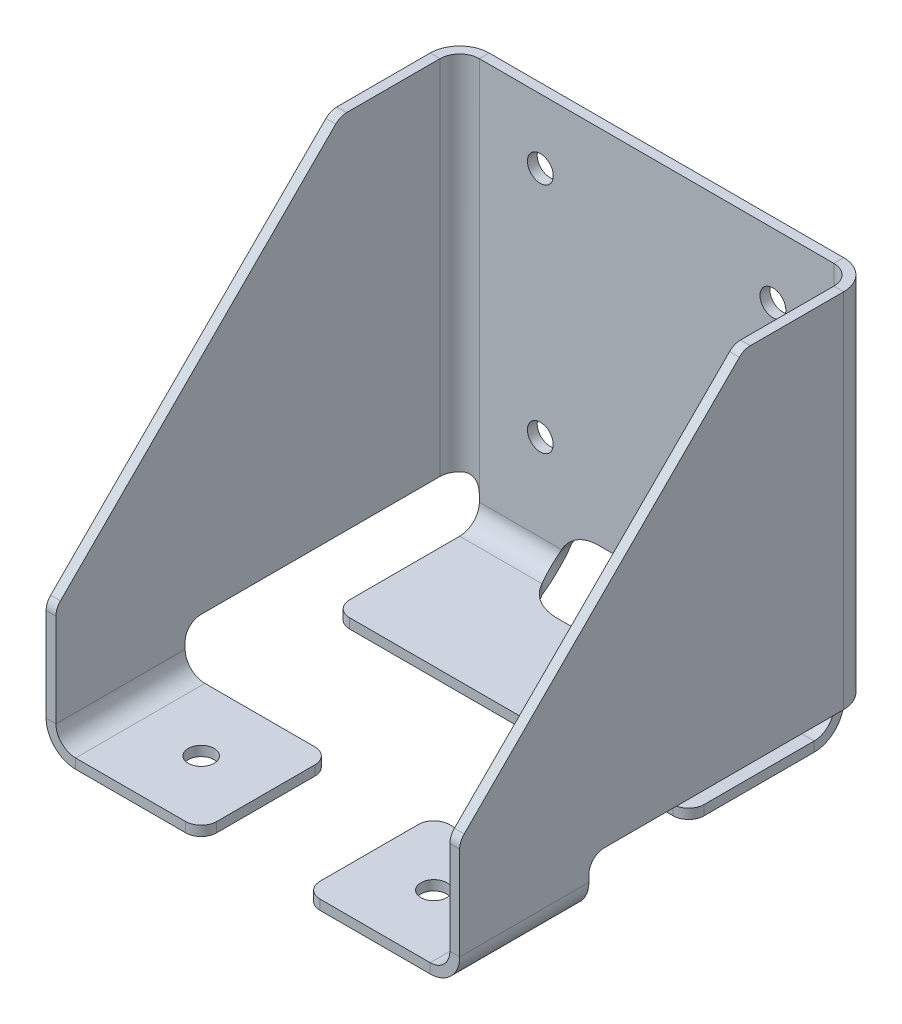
ISO-10303-21;
HEADER;
FILE_DESCRIPTION(('STEP AP214'),'2;1');
FILE_NAME('part.step','',(''),(''),'','','');
FILE_SCHEMA(('AUTOMOTIVE_DESIGN { 1 0 10303 214 1 1 1 1 }'));
ENDSEC;
DATA;
#1=APPLICATION_CONTEXT('core data for automotive mechanical design processes');
#2=APPLICATION_PROTOCOL_DEFINITION('international standard','automotive_design',2000,#1);
#3=PRODUCT_CONTEXT('',#1,'mechanical');
#4=PRODUCT('Part','Part','',(#3));
#5=PRODUCT_RELATED_PRODUCT_CATEGORY('part','',(#4));
#6=PRODUCT_DEFINITION_FORMATION('','',#4);
#7=PRODUCT_DEFINITION_CONTEXT('part definition',#1,'design');
#8=PRODUCT_DEFINITION('design','',#6,#7);
#9=PRODUCT_DEFINITION_SHAPE('','',#8);
#10=(LENGTH_UNIT() NAMED_UNIT(*) SI_UNIT(.MILLI.,.METRE.));
#11=(NAMED_UNIT(*) PLANE_ANGLE_UNIT() SI_UNIT($,.RADIAN.));
#12=(NAMED_UNIT(*) SI_UNIT($,.STERADIAN.) SOLID_ANGLE_UNIT());
#13=UNCERTAINTY_MEASURE_WITH_UNIT(LENGTH_MEASURE(1.E-05),#10,'distance_accuracy_value','');
#14=(GEOMETRIC_REPRESENTATION_CONTEXT(3) GLOBAL_UNCERTAINTY_ASSIGNED_CONTEXT((#13)) GLOBAL_UNIT_ASSIGNED_CONTEXT((#10,
#11,#12)) REPRESENTATION_CONTEXT('',''));
#15=CARTESIAN_POINT('',(0.,0.,0.));
#16=DIRECTION('',(0.,0.,1.));
#17=DIRECTION('',(1.,0.,0.));
#18=AXIS2_PLACEMENT_3D('',#15,#16,#17);
#19=CARTESIAN_POINT('',(-38.10262,70.,5.70738));
#20=DIRECTION('',(0.,1.,0.));
#21=DIRECTION('',(0.,0.,1.));
#22=AXIS2_PLACEMENT_3D('',#19,#20,#21);
#23=PLANE('',#22);
#24=DIRECTION('',(-1.,0.,0.));
#25=VECTOR('',#24,1.);
#26=CARTESIAN_POINT('',(0.,70.,0.));
#27=LINE('',#26,#25);
#28=CARTESIAN_POINT('',(34.29262,70.,0.));
#29=VERTEX_POINT('',#28);
#30=CARTESIAN_POINT('',(-34.29262,70.,0.));
#31=VERTEX_POINT('',#30);
#32=EDGE_CURVE('E1205',#29,#31,#27,.T.);
#33=ORIENTED_EDGE('',*,*,#32,.T.);
#34=DIRECTION('',(0.,0.,1.));
#35=VECTOR('',#34,1.);
#36=CARTESIAN_POINT('',(-34.29262,70.,0.));
#37=LINE('',#36,#35);
#38=CARTESIAN_POINT('',(-34.29262,70.,1.89738));
#39=VERTEX_POINT('',#38);
#40=EDGE_CURVE('E1266',#31,#39,#37,.T.);
#41=ORIENTED_EDGE('',*,*,#40,.T.);
#42=DIRECTION('',(1.,0.,0.));
#43=VECTOR('',#42,1.);
#44=CARTESIAN_POINT('',(0.,70.,1.89738));
#45=LINE('',#44,#43);
#46=CARTESIAN_POINT('',(34.29262,70.,1.89738));
#47=VERTEX_POINT('',#46);
#48=EDGE_CURVE('E1202',#47,#39,#45,.F.);
#49=ORIENTED_EDGE('',*,*,#48,.F.);
#50=DIRECTION('',(0.,0.,1.));
#51=VECTOR('',#50,1.);
#52=CARTESIAN_POINT('',(34.29262,70.,0.));
#53=LINE('',#52,#51);
#54=EDGE_CURVE('E1210',#29,#47,#53,.T.);
#55=ORIENTED_EDGE('',*,*,#54,.F.);
#56=EDGE_LOOP('',(#33,#41,#49,#55));
#57=FACE_BOUND('',#56,.T.);
#58=ADVANCED_FACE('F106',(#57),#23,.T.);
#59=CARTESIAN_POINT('',(0.,70.,1.89738));
#60=DIRECTION('',(0.,0.,1.));
#61=DIRECTION('',(1.,0.,0.));
#62=AXIS2_PLACEMENT_3D('',#59,#60,#61);
#63=PLANE('',#62);
#64=CARTESIAN_POINT('',(-11.2625336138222,-8.03008638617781,1.89738));
#65=DIRECTION('',(0.,0.,1.));
#66=DIRECTION('',(1.,0.,0.));
#67=AXIS2_PLACEMENT_3D('',#64,#65,#66);
#68=CIRCLE('',#67,8.03008638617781);
#69=CARTESIAN_POINT('',(-11.2625336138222,0.,1.89738));
#70=VERTEX_POINT('',#69);
#71=CARTESIAN_POINT('',(-18.3698279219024,-4.29262000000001,1.89738));
#72=VERTEX_POINT('',#71);
#73=EDGE_CURVE('E1362',#70,#72,#68,.T.);
#74=ORIENTED_EDGE('',*,*,#73,.F.);
#75=DIRECTION('',(-1.,0.,0.));
#76=VECTOR('',#75,1.);
#77=CARTESIAN_POINT('',(-11.2625336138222,0.,1.89738));
#78=LINE('',#77,#76);
#79=CARTESIAN_POINT('',(11.2625336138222,0.,1.89738));
#80=VERTEX_POINT('',#79);
#81=EDGE_CURVE('E1168',#80,#70,#78,.T.);
#82=ORIENTED_EDGE('',*,*,#81,.F.);
#83=CARTESIAN_POINT('',(11.2625336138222,-8.03008638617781,1.89738));
#84=DIRECTION('',(0.,0.,1.));
#85=DIRECTION('',(1.,0.,0.));
#86=AXIS2_PLACEMENT_3D('',#83,#84,#85);
#87=CIRCLE('',#86,8.03008638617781);
#88=CARTESIAN_POINT('',(18.3698279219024,-4.29262000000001,1.89738));
#89=VERTEX_POINT('',#88);
#90=EDGE_CURVE('E1172',#89,#80,#87,.T.);
#91=ORIENTED_EDGE('',*,*,#90,.F.);
#92=DIRECTION('',(-1.,0.,0.));
#93=VECTOR('',#92,1.);
#94=CARTESIAN_POINT('',(0.,-4.29262000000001,1.89738));
#95=LINE('',#94,#93);
#96=CARTESIAN_POINT('',(34.29262,-4.29262000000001,1.89738));
#97=VERTEX_POINT('',#96);
#98=EDGE_CURVE('E1387',#97,#89,#95,.T.);
#99=ORIENTED_EDGE('',*,*,#98,.F.);
#100=DIRECTION('',(0.,1.,0.));
#101=VECTOR('',#100,1.);
#102=CARTESIAN_POINT('',(34.29262,-4.29262000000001,1.89738));
#103=LINE('',#102,#101);
#104=CARTESIAN_POINT('',(34.29262,-2.9999958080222,1.89738));
#105=VERTEX_POINT('',#104);
#106=EDGE_CURVE('E1201',#97,#105,#103,.T.);
#107=ORIENTED_EDGE('',*,*,#106,.T.);
#108=DIRECTION('',(0.,-1.,0.));
#109=VECTOR('',#108,1.);
#110=CARTESIAN_POINT('',(34.29262,70.,1.89738));
#111=LINE('',#110,#109);
#112=EDGE_CURVE('E1209',#47,#105,#111,.T.);
#113=ORIENTED_EDGE('',*,*,#112,.F.);
#114=ORIENTED_EDGE('',*,*,#48,.T.);
#115=DIRECTION('',(0.,-1.,0.));
#116=VECTOR('',#115,1.);
#117=CARTESIAN_POINT('',(-34.29262,70.,1.89738));
#118=LINE('',#117,#116);
#119=CARTESIAN_POINT('',(-34.29262,-3.,1.89738));
#120=VERTEX_POINT('',#119);
#121=EDGE_CURVE('E1258',#39,#120,#118,.T.);
#122=ORIENTED_EDGE('',*,*,#121,.T.);
#123=DIRECTION('',(0.,1.,0.));
#124=VECTOR('',#123,1.);
#125=CARTESIAN_POINT('',(-34.29262,-4.29262000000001,1.89738));
#126=LINE('',#125,#124);
#127=CARTESIAN_POINT('',(-34.29262,-4.29262000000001,1.89738));
#128=VERTEX_POINT('',#127);
#129=EDGE_CURVE('E1217',#128,#120,#126,.T.);
#130=ORIENTED_EDGE('',*,*,#129,.F.);
#131=DIRECTION('',(-1.,0.,0.));
#132=VECTOR('',#131,1.);
#133=CARTESIAN_POINT('',(0.,-4.29262000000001,1.89738));
#134=LINE('',#133,#132);
#135=EDGE_CURVE('E1213',#72,#128,#134,.T.);
#136=ORIENTED_EDGE('',*,*,#135,.F.);
#137=EDGE_LOOP('',(#74,#82,#91,#99,#107,#113,#114,#122,#130,#136));
#138=FACE_BOUND('',#137,.T.);
#139=CARTESIAN_POINT('',(-22.5,57.5,1.89738));
#140=DIRECTION('',(0.,0.,1.));
#141=DIRECTION('',(1.,0.,0.));
#142=AXIS2_PLACEMENT_3D('',#139,#140,#141);
#143=CIRCLE('',#142,2.49999999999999);
#144=CARTESIAN_POINT('',(-20.,57.5,1.89738));
#145=VERTEX_POINT('',#144);
#146=EDGE_CURVE('E1175',#145,#145,#143,.T.);
#147=ORIENTED_EDGE('',*,*,#146,.F.);
#148=EDGE_LOOP('',(#147));
#149=FACE_BOUND('',#148,.T.);
#150=CARTESIAN_POINT('',(22.5,57.5,1.89738000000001));
#151=DIRECTION('',(0.,0.,1.));
#152=DIRECTION('',(1.,0.,0.));
#153=AXIS2_PLACEMENT_3D('',#150,#151,#152);
#154=CIRCLE('',#153,2.49999999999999);
#155=CARTESIAN_POINT('',(25.,57.5,1.89738000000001));
#156=VERTEX_POINT('',#155);
#157=EDGE_CURVE('E1183',#156,#156,#154,.T.);
#158=ORIENTED_EDGE('',*,*,#157,.F.);
#159=EDGE_LOOP('',(#158));
#160=FACE_BOUND('',#159,.T.);
#161=CARTESIAN_POINT('',(-22.5,12.5,1.89738));
#162=DIRECTION('',(0.,0.,1.));
#163=DIRECTION('',(1.,0.,0.));
#164=AXIS2_PLACEMENT_3D('',#161,#162,#163);
#165=CIRCLE('',#164,2.49999999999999);
#166=CARTESIAN_POINT('',(-20.,12.5,1.89738));
#167=VERTEX_POINT('',#166);
#168=EDGE_CURVE('E1189',#167,#167,#165,.T.);
#169=ORIENTED_EDGE('',*,*,#168,.F.);
#170=EDGE_LOOP('',(#169));
#171=FACE_BOUND('',#170,.T.);
#172=CARTESIAN_POINT('',(22.5,12.5,1.89738000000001));
#173=DIRECTION('',(0.,0.,1.));
#174=DIRECTION('',(1.,0.,0.));
#175=AXIS2_PLACEMENT_3D('',#172,#173,#174);
#176=CIRCLE('',#175,2.49999999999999);
#177=CARTESIAN_POINT('',(25.,12.5,1.89738000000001));
#178=VERTEX_POINT('',#177);
#179=EDGE_CURVE('E1195',#178,#178,#176,.T.);
#180=ORIENTED_EDGE('',*,*,#179,.F.);
#181=EDGE_LOOP('',(#180));
#182=FACE_BOUND('',#181,.T.);
#183=ADVANCED_FACE('F1411',(#138,#149,#160,#171,#182),#63,.T.);
#184=CARTESIAN_POINT('',(0.,70.,0.));
#185=DIRECTION('',(0.,0.,1.));
#186=DIRECTION('',(1.,0.,0.));
#187=AXIS2_PLACEMENT_3D('',#184,#185,#186);
#188=PLANE('',#187);
#189=CARTESIAN_POINT('',(-22.5,57.5,0.));
#190=DIRECTION('',(0.,0.,1.));
#191=DIRECTION('',(1.,0.,0.));
#192=AXIS2_PLACEMENT_3D('',#189,#190,#191);
#193=CIRCLE('',#192,2.49999999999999);
#194=CARTESIAN_POINT('',(-20.,57.5,0.));
#195=VERTEX_POINT('',#194);
#196=EDGE_CURVE('E1180',#195,#195,#193,.T.);
#197=ORIENTED_EDGE('',*,*,#196,.T.);
#198=EDGE_LOOP('',(#197));
#199=FACE_BOUND('',#198,.T.);
#200=CARTESIAN_POINT('',(22.5,57.5,0.));
#201=DIRECTION('',(0.,0.,1.));
#202=DIRECTION('',(1.,0.,0.));
#203=AXIS2_PLACEMENT_3D('',#200,#201,#202);
#204=CIRCLE('',#203,2.49999999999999);
#205=CARTESIAN_POINT('',(25.,57.5,0.));
#206=VERTEX_POINT('',#205);
#207=EDGE_CURVE('E1186',#206,#206,#204,.T.);
#208=ORIENTED_EDGE('',*,*,#207,.T.);
#209=EDGE_LOOP('',(#208));
#210=FACE_BOUND('',#209,.T.);
#211=CARTESIAN_POINT('',(-22.5,12.5,0.));
#212=DIRECTION('',(0.,0.,1.));
#213=DIRECTION('',(1.,0.,0.));
#214=AXIS2_PLACEMENT_3D('',#211,#212,#213);
#215=CIRCLE('',#214,2.49999999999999);
#216=CARTESIAN_POINT('',(-20.,12.5,0.));
#217=VERTEX_POINT('',#216);
#218=EDGE_CURVE('E1192',#217,#217,#215,.T.);
#219=ORIENTED_EDGE('',*,*,#218,.T.);
#220=EDGE_LOOP('',(#219));
#221=FACE_BOUND('',#220,.T.);
#222=CARTESIAN_POINT('',(22.5,12.5,0.));
#223=DIRECTION('',(0.,0.,1.));
#224=DIRECTION('',(1.,0.,0.));
#225=AXIS2_PLACEMENT_3D('',#222,#223,#224);
#226=CIRCLE('',#225,2.49999999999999);
#227=CARTESIAN_POINT('',(25.,12.5,0.));
#228=VERTEX_POINT('',#227);
#229=EDGE_CURVE('E1198',#228,#228,#226,.T.);
#230=ORIENTED_EDGE('',*,*,#229,.T.);
#231=EDGE_LOOP('',(#230));
#232=FACE_BOUND('',#231,.T.);
#233=DIRECTION('',(-1.,0.,0.));
#234=VECTOR('',#233,1.);
#235=CARTESIAN_POINT('',(-11.2625336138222,0.,0.));
#236=LINE('',#235,#234);
#237=CARTESIAN_POINT('',(11.2625336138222,0.,0.));
#238=VERTEX_POINT('',#237);
#239=CARTESIAN_POINT('',(-11.2625336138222,0.,0.));
#240=VERTEX_POINT('',#239);
#241=EDGE_CURVE('E1158',#238,#240,#236,.T.);
#242=ORIENTED_EDGE('',*,*,#241,.T.);
#243=CARTESIAN_POINT('',(-11.2625336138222,-8.03008638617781,0.));
#244=DIRECTION('',(0.,0.,1.));
#245=DIRECTION('',(1.,0.,0.));
#246=AXIS2_PLACEMENT_3D('',#243,#244,#245);
#247=CIRCLE('',#246,8.03008638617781);
#248=CARTESIAN_POINT('',(-18.3698279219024,-4.29262000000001,0.));
#249=VERTEX_POINT('',#248);
#250=EDGE_CURVE('E1171',#240,#249,#247,.T.);
#251=ORIENTED_EDGE('',*,*,#250,.T.);
#252=DIRECTION('',(-1.,0.,0.));
#253=VECTOR('',#252,1.);
#254=CARTESIAN_POINT('',(0.,-4.29262000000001,0.));
#255=LINE('',#254,#253);
#256=CARTESIAN_POINT('',(-34.29262,-4.29262000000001,0.));
#257=VERTEX_POINT('',#256);
#258=EDGE_CURVE('E1375',#249,#257,#255,.T.);
#259=ORIENTED_EDGE('',*,*,#258,.T.);
#260=DIRECTION('',(0.,1.,0.));
#261=VECTOR('',#260,1.);
#262=CARTESIAN_POINT('',(-34.29262,-4.29262000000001,0.));
#263=LINE('',#262,#261);
#264=CARTESIAN_POINT('',(-34.29262,-2.9999958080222,0.));
#265=VERTEX_POINT('',#264);
#266=EDGE_CURVE('E1206',#257,#265,#263,.T.);
#267=ORIENTED_EDGE('',*,*,#266,.T.);
#268=DIRECTION('',(0.,-1.,0.));
#269=VECTOR('',#268,1.);
#270=CARTESIAN_POINT('',(-34.29262,70.,0.));
#271=LINE('',#270,#269);
#272=EDGE_CURVE('E116',#31,#265,#271,.T.);
#273=ORIENTED_EDGE('',*,*,#272,.F.);
#274=ORIENTED_EDGE('',*,*,#32,.F.);
#275=DIRECTION('',(0.,-1.,0.));
#276=VECTOR('',#275,1.);
#277=CARTESIAN_POINT('',(34.29262,70.,0.));
#278=LINE('',#277,#276);
#279=CARTESIAN_POINT('',(34.29262,-3.,0.));
#280=VERTEX_POINT('',#279);
#281=EDGE_CURVE('E1214',#29,#280,#278,.T.);
#282=ORIENTED_EDGE('',*,*,#281,.T.);
#283=DIRECTION('',(0.,1.,0.));
#284=VECTOR('',#283,1.);
#285=CARTESIAN_POINT('',(34.29262,-4.29262000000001,0.));
#286=LINE('',#285,#284);
#287=CARTESIAN_POINT('',(34.29262,-4.29262000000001,0.));
#288=VERTEX_POINT('',#287);
#289=EDGE_CURVE('E1215',#288,#280,#286,.T.);
#290=ORIENTED_EDGE('',*,*,#289,.F.);
#291=DIRECTION('',(-1.,0.,0.));
#292=VECTOR('',#291,1.);
#293=CARTESIAN_POINT('',(0.,-4.29262000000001,0.));
#294=LINE('',#293,#292);
#295=CARTESIAN_POINT('',(18.3698279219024,-4.29262000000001,0.));
#296=VERTEX_POINT('',#295);
#297=EDGE_CURVE('E130',#288,#296,#294,.T.);
#298=ORIENTED_EDGE('',*,*,#297,.T.);
#299=CARTESIAN_POINT('',(11.2625336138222,-8.03008638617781,0.));
#300=DIRECTION('',(0.,0.,1.));
#301=DIRECTION('',(1.,0.,0.));
#302=AXIS2_PLACEMENT_3D('',#299,#300,#301);
#303=CIRCLE('',#302,8.03008638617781);
#304=EDGE_CURVE('E1167',#296,#238,#303,.T.);
#305=ORIENTED_EDGE('',*,*,#304,.T.);
#306=EDGE_LOOP('',(#242,#251,#259,#267,#273,#274,#282,#290,#298,#305));
#307=FACE_BOUND('',#306,.T.);
#308=ADVANCED_FACE('F1249',(#199,#210,#221,#232,#307),#188,.F.);
#309=CARTESIAN_POINT('',(-34.29262,-4.29262000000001,1.89738));
#310=DIRECTION('',(1.,0.,0.));
#311=DIRECTION('',(0.,0.,-1.));
#312=AXIS2_PLACEMENT_3D('',#309,#310,#311);
#313=PLANE('',#312);
#314=ORIENTED_EDGE('',*,*,#129,.T.);
#315=CARTESIAN_POINT('',(-34.29262,-3.,0.));
#316=CARTESIAN_POINT('',(-34.29262,-3.,1.89738));
#317=B_SPLINE_CURVE_WITH_KNOTS('',1,(#315,#316),.UNSPECIFIED.,.F.,.F.,(2,2),(0.,1.),.UNSPECIFIED.);
#318=EDGE_CURVE('E13',#120,#265,#317,.F.);
#319=ORIENTED_EDGE('',*,*,#318,.T.);
#320=ORIENTED_EDGE('',*,*,#266,.F.);
#321=DIRECTION('',(0.,0.,-1.));
#322=VECTOR('',#321,1.);
#323=CARTESIAN_POINT('',(-34.29262,-4.29262000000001,1.89738));
#324=LINE('',#323,#322);
#325=EDGE_CURVE('E1357',#128,#257,#324,.T.);
#326=ORIENTED_EDGE('',*,*,#325,.F.);
#327=EDGE_LOOP('',(#314,#319,#320,#326));
#328=FACE_BOUND('',#327,.T.);
#329=ADVANCED_FACE('F1244',(#328),#313,.F.);
#330=CARTESIAN_POINT('',(34.29262,-4.29262000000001,1.89738));
#331=DIRECTION('',(-1.,0.,0.));
#332=DIRECTION('',(0.,0.,-1.));
#333=AXIS2_PLACEMENT_3D('',#330,#331,#332);
#334=PLANE('',#333);
#335=ORIENTED_EDGE('',*,*,#289,.T.);
#336=CARTESIAN_POINT('',(34.29262,-3.,1.89738));
#337=CARTESIAN_POINT('',(34.29262,-3.,0.));
#338=B_SPLINE_CURVE_WITH_KNOTS('',1,(#336,#337),.UNSPECIFIED.,.F.,.F.,(2,2),(0.,1.),.UNSPECIFIED.);
#339=EDGE_CURVE('E1154',#280,#105,#338,.F.);
#340=ORIENTED_EDGE('',*,*,#339,.T.);
#341=ORIENTED_EDGE('',*,*,#106,.F.);
#342=DIRECTION('',(0.,0.,-1.));
#343=VECTOR('',#342,1.);
#344=CARTESIAN_POINT('',(34.29262,-4.29262000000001,1.89738));
#345=LINE('',#344,#343);
#346=EDGE_CURVE('E1267',#97,#288,#345,.T.);
#347=ORIENTED_EDGE('',*,*,#346,.T.);
#348=EDGE_LOOP('',(#335,#340,#341,#347));
#349=FACE_BOUND('',#348,.T.);
#350=ADVANCED_FACE('F1233',(#349),#334,.F.);
#351=CARTESIAN_POINT('',(22.5,12.5,1.89738000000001));
#352=DIRECTION('',(0.,0.,1.));
#353=DIRECTION('',(1.,0.,0.));
#354=AXIS2_PLACEMENT_3D('',#351,#352,#353);
#355=CYLINDRICAL_SURFACE('',#354,2.49999999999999);
#356=ORIENTED_EDGE('',*,*,#229,.F.);
#357=EDGE_LOOP('',(#356));
#358=FACE_BOUND('',#357,.T.);
#359=ORIENTED_EDGE('',*,*,#179,.T.);
#360=EDGE_LOOP('',(#359));
#361=FACE_BOUND('',#360,.T.);
#362=ADVANCED_FACE('F1243',(#358,#361),#355,.F.);
#363=CARTESIAN_POINT('',(-22.5,12.5,1.89738));
#364=DIRECTION('',(0.,0.,1.));
#365=DIRECTION('',(1.,0.,0.));
#366=AXIS2_PLACEMENT_3D('',#363,#364,#365);
#367=CYLINDRICAL_SURFACE('',#366,2.49999999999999);
#368=ORIENTED_EDGE('',*,*,#218,.F.);
#369=EDGE_LOOP('',(#368));
#370=FACE_BOUND('',#369,.T.);
#371=ORIENTED_EDGE('',*,*,#168,.T.);
#372=EDGE_LOOP('',(#371));
#373=FACE_BOUND('',#372,.T.);
#374=ADVANCED_FACE('F1431',(#370,#373),#367,.F.);
#375=CARTESIAN_POINT('',(22.5,57.5,1.89738000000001));
#376=DIRECTION('',(0.,0.,1.));
#377=DIRECTION('',(1.,0.,0.));
#378=AXIS2_PLACEMENT_3D('',#375,#376,#377);
#379=CYLINDRICAL_SURFACE('',#378,2.49999999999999);
#380=ORIENTED_EDGE('',*,*,#207,.F.);
#381=EDGE_LOOP('',(#380));
#382=FACE_BOUND('',#381,.T.);
#383=ORIENTED_EDGE('',*,*,#157,.T.);
#384=EDGE_LOOP('',(#383));
#385=FACE_BOUND('',#384,.T.);
#386=ADVANCED_FACE('F1436',(#382,#385),#379,.F.);
#387=CARTESIAN_POINT('',(-22.5,57.5,1.89738));
#388=DIRECTION('',(0.,0.,1.));
#389=DIRECTION('',(1.,0.,0.));
#390=AXIS2_PLACEMENT_3D('',#387,#388,#389);
#391=CYLINDRICAL_SURFACE('',#390,2.49999999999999);
#392=ORIENTED_EDGE('',*,*,#196,.F.);
#393=EDGE_LOOP('',(#392));
#394=FACE_BOUND('',#393,.T.);
#395=ORIENTED_EDGE('',*,*,#146,.T.);
#396=EDGE_LOOP('',(#395));
#397=FACE_BOUND('',#396,.T.);
#398=ADVANCED_FACE('F1443',(#394,#397),#391,.F.);
#399=CARTESIAN_POINT('',(-11.2625336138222,-8.03008638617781,0.));
#400=DIRECTION('',(0.,0.,1.));
#401=DIRECTION('',(1.,0.,0.));
#402=AXIS2_PLACEMENT_3D('',#399,#400,#401);
#403=CYLINDRICAL_SURFACE('',#402,8.03008638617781);
#404=CARTESIAN_POINT('',(-18.3698279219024,-4.29262000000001,0.));
#405=CARTESIAN_POINT('',(-18.3698279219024,-4.29262000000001,1.89738));
#406=B_SPLINE_CURVE_WITH_KNOTS('',1,(#404,#405),.UNSPECIFIED.,.F.,.F.,(2,2),(0.,1.),.UNSPECIFIED.);
#407=EDGE_CURVE('E1371',#249,#72,#406,.T.);
#408=ORIENTED_EDGE('',*,*,#407,.F.);
#409=ORIENTED_EDGE('',*,*,#250,.F.);
#410=DIRECTION('',(0.,0.,1.));
#411=VECTOR('',#410,1.);
#412=CARTESIAN_POINT('',(-11.2625336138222,0.,0.));
#413=LINE('',#412,#411);
#414=EDGE_CURVE('E1173',#240,#70,#413,.T.);
#415=ORIENTED_EDGE('',*,*,#414,.T.);
#416=ORIENTED_EDGE('',*,*,#73,.T.);
#417=EDGE_LOOP('',(#408,#409,#415,#416));
#418=FACE_BOUND('',#417,.T.);
#419=ADVANCED_FACE('F108',(#418),#403,.F.);
#420=CARTESIAN_POINT('',(-11.2625336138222,0.,0.));
#421=DIRECTION('',(0.,1.,0.));
#422=DIRECTION('',(0.,0.,1.));
#423=AXIS2_PLACEMENT_3D('',#420,#421,#422);
#424=PLANE('',#423);
#425=ORIENTED_EDGE('',*,*,#81,.T.);
#426=ORIENTED_EDGE('',*,*,#414,.F.);
#427=ORIENTED_EDGE('',*,*,#241,.F.);
#428=DIRECTION('',(0.,0.,1.));
#429=VECTOR('',#428,1.);
#430=CARTESIAN_POINT('',(11.2625336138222,0.,0.));
#431=LINE('',#430,#429);
#432=EDGE_CURVE('E1166',#238,#80,#431,.T.);
#433=ORIENTED_EDGE('',*,*,#432,.T.);
#434=EDGE_LOOP('',(#425,#426,#427,#433));
#435=FACE_BOUND('',#434,.T.);
#436=ADVANCED_FACE('F1409',(#435),#424,.F.);
#437=CARTESIAN_POINT('',(11.2625336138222,-8.03008638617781,0.));
#438=DIRECTION('',(0.,0.,1.));
#439=DIRECTION('',(1.,0.,0.));
#440=AXIS2_PLACEMENT_3D('',#437,#438,#439);
#441=CYLINDRICAL_SURFACE('',#440,8.03008638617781);
#442=CARTESIAN_POINT('',(18.3698279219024,-4.29262000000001,1.89738));
#443=CARTESIAN_POINT('',(18.3698279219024,-4.29262000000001,0.));
#444=B_SPLINE_CURVE_WITH_KNOTS('',1,(#442,#443),.UNSPECIFIED.,.F.,.F.,(2,2),(0.,1.),.UNSPECIFIED.);
#445=EDGE_CURVE('E809',#89,#296,#444,.T.);
#446=ORIENTED_EDGE('',*,*,#445,.F.);
#447=ORIENTED_EDGE('',*,*,#90,.T.);
#448=ORIENTED_EDGE('',*,*,#432,.F.);
#449=ORIENTED_EDGE('',*,*,#304,.F.);
#450=EDGE_LOOP('',(#446,#447,#448,#449));
#451=FACE_BOUND('',#450,.T.);
#452=ADVANCED_FACE('F1400',(#451),#441,.F.);
#453=CARTESIAN_POINT('',(34.29262,70.,5.70738));
#454=DIRECTION('',(0.,-1.,0.));
#455=DIRECTION('',(0.,0.,-1.));
#456=AXIS2_PLACEMENT_3D('',#453,#454,#455);
#457=PLANE('',#456);
#458=DIRECTION('',(1.,0.,0.));
#459=VECTOR('',#458,1.);
#460=CARTESIAN_POINT('',(38.10262,70.,5.70737999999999));
#461=LINE('',#460,#459);
#462=CARTESIAN_POINT('',(38.10262,70.,5.70738));
#463=VERTEX_POINT('',#462);
#464=CARTESIAN_POINT('',(40.,70.,5.70737999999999));
#465=VERTEX_POINT('',#464);
#466=EDGE_CURVE('E821',#463,#465,#461,.T.);
#467=ORIENTED_EDGE('',*,*,#466,.T.);
#468=CARTESIAN_POINT('',(34.29262,70.,5.70738));
#469=DIRECTION('',(0.,1.,0.));
#470=DIRECTION('',(0.,0.,1.));
#471=AXIS2_PLACEMENT_3D('',#468,#469,#470);
#472=CIRCLE('',#471,5.70738);
#473=EDGE_CURVE('E907',#465,#29,#472,.T.);
#474=ORIENTED_EDGE('',*,*,#473,.T.);
#475=ORIENTED_EDGE('',*,*,#54,.T.);
#476=CARTESIAN_POINT('',(34.29262,70.,5.70738));
#477=DIRECTION('',(0.,1.,0.));
#478=DIRECTION('',(0.,0.,1.));
#479=AXIS2_PLACEMENT_3D('',#476,#477,#478);
#480=CIRCLE('',#479,3.81);
#481=EDGE_CURVE('E1046',#463,#47,#480,.T.);
#482=ORIENTED_EDGE('',*,*,#481,.F.);
#483=EDGE_LOOP('',(#467,#474,#475,#482));
#484=FACE_BOUND('',#483,.T.);
#485=ADVANCED_FACE('F1117',(#484),#457,.F.);
#486=CARTESIAN_POINT('',(34.29262,-3.,0.));
#487=CARTESIAN_POINT('',(34.3482854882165,-2.55209468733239,0.));
#488=CARTESIAN_POINT('',(34.4445815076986,-2.17087079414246,0.000383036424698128));
#489=CARTESIAN_POINT('',(34.649551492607,-1.69906968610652,0.0107611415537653));
#490=CARTESIAN_POINT('',(34.7279541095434,-1.55847440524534,0.0159356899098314));
#491=CARTESIAN_POINT('',(34.8273204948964,-1.41906043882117,0.0250913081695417));
#492=CARTESIAN_POINT('',(34.8385160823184,-1.4038304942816,0.0261553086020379));
#493=CARTESIAN_POINT('',(34.8555410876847,-1.3813763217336,0.0278255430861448));
#494=CARTESIAN_POINT('',(34.8612546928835,-1.37395672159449,0.0283946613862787));
#495=CARTESIAN_POINT('',(34.8727589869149,-1.35924776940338,0.0295583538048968));
#496=CARTESIAN_POINT('',(34.8829816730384,-1.34633402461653,0.0306078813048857));
#497=CARTESIAN_POINT('',(34.928043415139,-1.29016445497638,0.0353664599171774));
#498=CARTESIAN_POINT('',(34.9649119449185,-1.24636105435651,0.0396069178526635));
#499=CARTESIAN_POINT('',(35.0779365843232,-1.11834761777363,0.053776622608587));
#500=CARTESIAN_POINT('',(35.1565143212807,-1.03753434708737,0.0651524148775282));
#501=CARTESIAN_POINT('',(35.5648887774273,-0.656113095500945,0.133757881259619));
#502=CARTESIAN_POINT('',(35.9422891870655,-0.423440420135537,0.225813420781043));
#503=CARTESIAN_POINT('',(36.7654219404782,-0.103023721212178,0.544606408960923));
#504=CARTESIAN_POINT('',(37.2110732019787,-0.0152985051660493,0.771628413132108));
#505=CARTESIAN_POINT('',(37.6570554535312,0.,1.09709144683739));
#506=CARTESIAN_POINT('',(34.29262,-3.,1.89738));
#507=CARTESIAN_POINT('',(34.3297799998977,-2.55209314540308,1.89738));
#508=CARTESIAN_POINT('',(34.3940629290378,-2.17087079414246,1.89763569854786));
#509=CARTESIAN_POINT('',(34.5308920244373,-1.69906968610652,1.90456367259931));
#510=CARTESIAN_POINT('',(34.5832302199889,-1.55847440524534,1.90801797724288));
#511=CARTESIAN_POINT('',(34.6495629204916,-1.41906043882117,1.91412987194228));
#512=CARTESIAN_POINT('',(34.6570366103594,-1.4038304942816,1.91484015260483));
#513=CARTESIAN_POINT('',(34.6684017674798,-1.3813763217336,1.91595512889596));
#514=CARTESIAN_POINT('',(34.6722159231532,-1.37395672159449,1.91633504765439));
#515=CARTESIAN_POINT('',(34.6798956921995,-1.35924776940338,1.91711187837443));
#516=CARTESIAN_POINT('',(34.6867199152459,-1.34633402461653,1.9178124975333));
#517=CARTESIAN_POINT('',(34.716801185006,-1.29016445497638,1.92098911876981));
#518=CARTESIAN_POINT('',(34.7414130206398,-1.24636105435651,1.92381986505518));
#519=CARTESIAN_POINT('',(34.8168633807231,-1.11834761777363,1.93327894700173));
#520=CARTESIAN_POINT('',(34.8693184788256,-1.03753434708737,1.94087293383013));
#521=CARTESIAN_POINT('',(35.1419316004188,-0.656113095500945,1.98667097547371));
#522=CARTESIAN_POINT('',(35.3938677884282,-0.423440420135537,2.04812327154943));
#523=CARTESIAN_POINT('',(35.9433556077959,-0.103023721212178,2.26093568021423));
#524=CARTESIAN_POINT('',(36.2408534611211,-0.0152984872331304,2.41248600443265));
#525=CARTESIAN_POINT('',(36.5385715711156,0.,2.62975079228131));
#526=B_SPLINE_SURFACE_WITH_KNOTS('',1,3,((#486,#487,#488,#489,#490,#491,#492,#493,#494,#495,
#496,#497,#498,#499,#500,#501,#502,#503,#504,#505),(#506,#507,#508,#509,#510,#511,#512,#513,
#514,#515,#516,#517,#518,#519,#520,#521,#522,#523,#524,#525)),.UNSPECIFIED.,.F.,.F.,.F.,(2,2),
(4,2,2,2,2,2,2,2,2,4),(0.,1.),(0.,0.25,0.375,0.390625,0.3984375,0.40625,0.4375,0.5,0.75,1.),.UNSPECIFIED.);
#527=CARTESIAN_POINT('',(34.29262,-3.,0.));
#528=CARTESIAN_POINT('',(34.3482854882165,-2.55209468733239,0.));
#529=CARTESIAN_POINT('',(34.4445815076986,-2.17087079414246,0.000383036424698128));
#530=CARTESIAN_POINT('',(34.649551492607,-1.69906968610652,0.0107611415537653));
#531=CARTESIAN_POINT('',(34.7279541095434,-1.55847440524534,0.0159356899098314));
#532=CARTESIAN_POINT('',(34.8273204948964,-1.41906043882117,0.0250913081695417));
#533=CARTESIAN_POINT('',(34.8385160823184,-1.4038304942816,0.0261553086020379));
#534=CARTESIAN_POINT('',(34.8555410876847,-1.3813763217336,0.0278255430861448));
#535=CARTESIAN_POINT('',(34.8612546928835,-1.37395672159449,0.0283946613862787));
#536=CARTESIAN_POINT('',(34.8727589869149,-1.35924776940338,0.0295583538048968));
#537=CARTESIAN_POINT('',(34.8829816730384,-1.34633402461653,0.0306078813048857));
#538=CARTESIAN_POINT('',(34.928043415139,-1.29016445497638,0.0353664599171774));
#539=CARTESIAN_POINT('',(34.9649119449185,-1.24636105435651,0.0396069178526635));
#540=CARTESIAN_POINT('',(35.0779365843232,-1.11834761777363,0.053776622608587));
#541=CARTESIAN_POINT('',(35.1565143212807,-1.03753434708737,0.0651524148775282));
#542=CARTESIAN_POINT('',(35.5648887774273,-0.656113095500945,0.133757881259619));
#543=CARTESIAN_POINT('',(35.9422891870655,-0.423440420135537,0.225813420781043));
#544=CARTESIAN_POINT('',(36.7654219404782,-0.103023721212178,0.544606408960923));
#545=CARTESIAN_POINT('',(37.2110732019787,-0.0152985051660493,0.771628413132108));
#546=CARTESIAN_POINT('',(37.6570554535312,0.,1.09709144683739));
#547=B_SPLINE_CURVE_WITH_KNOTS('',3,(#527,#528,#529,#530,#531,#532,#533,#534,#535,#536,#537,
#538,#539,#540,#541,#542,#543,#544,#545,#546),.UNSPECIFIED.,.F.,.F.,(4,2,2,2,2,2,2,2,2,4),(0.,
0.25,0.375,0.390625,0.3984375,0.40625,0.4375,0.5,0.75,1.),.UNSPECIFIED.);
#548=CARTESIAN_POINT('',(37.6570554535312,0.,1.09709144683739));
#549=VERTEX_POINT('',#548);
#550=EDGE_CURVE('E1053',#280,#549,#547,.T.);
#551=CARTESIAN_POINT('',(37.6570554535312,0.,1.09709144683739));
#552=CARTESIAN_POINT('',(36.5385715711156,0.,2.62975079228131));
#553=B_SPLINE_CURVE_WITH_KNOTS('',1,(#551,#552),.UNSPECIFIED.,.F.,.F.,(2,2),(0.,1.),.UNSPECIFIED.);
#554=CARTESIAN_POINT('',(36.5385715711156,0.,2.62975079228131));
#555=VERTEX_POINT('',#554);
#556=EDGE_CURVE('E1143',#549,#555,#553,.T.);
#557=CARTESIAN_POINT('',(36.5385715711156,0.,2.62975079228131));
#558=CARTESIAN_POINT('',(36.2408534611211,-0.0152984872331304,2.41248600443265));
#559=CARTESIAN_POINT('',(35.9433556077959,-0.103023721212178,2.26093568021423));
#560=CARTESIAN_POINT('',(35.3938677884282,-0.423440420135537,2.04812327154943));
#561=CARTESIAN_POINT('',(35.1419316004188,-0.656113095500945,1.98667097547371));
#562=CARTESIAN_POINT('',(34.8693184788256,-1.03753434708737,1.94087293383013));
#563=CARTESIAN_POINT('',(34.8168633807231,-1.11834761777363,1.93327894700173));
#564=CARTESIAN_POINT('',(34.7414130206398,-1.24636105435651,1.92381986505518));
#565=CARTESIAN_POINT('',(34.716801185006,-1.29016445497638,1.92098911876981));
#566=CARTESIAN_POINT('',(34.6867199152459,-1.34633402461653,1.9178124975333));
#567=CARTESIAN_POINT('',(34.6798956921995,-1.35924776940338,1.91711187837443));
#568=CARTESIAN_POINT('',(34.6722159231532,-1.37395672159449,1.91633504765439));
#569=CARTESIAN_POINT('',(34.6684017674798,-1.3813763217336,1.91595512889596));
#570=CARTESIAN_POINT('',(34.6570366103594,-1.4038304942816,1.91484015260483));
#571=CARTESIAN_POINT('',(34.6495629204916,-1.41906043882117,1.91412987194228));
#572=CARTESIAN_POINT('',(34.5832302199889,-1.55847440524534,1.90801797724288));
#573=CARTESIAN_POINT('',(34.5308920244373,-1.69906968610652,1.90456367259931));
#574=CARTESIAN_POINT('',(34.3940629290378,-2.17087079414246,1.89763569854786));
#575=CARTESIAN_POINT('',(34.3297799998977,-2.55209314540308,1.89738));
#576=CARTESIAN_POINT('',(34.29262,-3.,1.89738));
#577=B_SPLINE_CURVE_WITH_KNOTS('',3,(#557,#558,#559,#560,#561,#562,#563,#564,#565,#566,#567,
#568,#569,#570,#571,#572,#573,#574,#575,#576),.UNSPECIFIED.,.F.,.F.,(4,2,2,2,2,2,2,2,2,4),(0.,
0.25,0.5,0.5625,0.59375,0.6015625,0.609375,0.625,0.75,1.),.UNSPECIFIED.);
#578=EDGE_CURVE('E1049',#105,#555,#577,.F.);
#579=ORIENTED_EDGE('',*,*,#339,.F.);
#580=ORIENTED_EDGE('',*,*,#550,.T.);
#581=ORIENTED_EDGE('',*,*,#556,.T.);
#582=ORIENTED_EDGE('',*,*,#578,.F.);
#583=EDGE_LOOP('',(#579,#580,#581,#582));
#584=FACE_BOUND('',#583,.T.);
#585=ADVANCED_FACE('F1106',(#584),#526,.F.);
#586=CARTESIAN_POINT('',(34.29262,0.,5.70738));
#587=DIRECTION('',(0.,1.,0.));
#588=DIRECTION('',(0.,0.,1.));
#589=AXIS2_PLACEMENT_3D('',#586,#587,#588);
#590=PLANE('',#589);
#591=ORIENTED_EDGE('',*,*,#556,.F.);
#592=CARTESIAN_POINT('',(34.29262,0.,5.70738));
#593=DIRECTION('',(0.,1.,0.));
#594=DIRECTION('',(0.,0.,1.));
#595=AXIS2_PLACEMENT_3D('',#592,#593,#594);
#596=CIRCLE('',#595,5.70738);
#597=CARTESIAN_POINT('',(40.,0.,5.70737999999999));
#598=VERTEX_POINT('',#597);
#599=EDGE_CURVE('E1050',#549,#598,#596,.F.);
#600=ORIENTED_EDGE('',*,*,#599,.T.);
#601=DIRECTION('',(-1.,0.,0.));
#602=VECTOR('',#601,1.);
#603=CARTESIAN_POINT('',(40.,0.,5.70737999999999));
#604=LINE('',#603,#602);
#605=CARTESIAN_POINT('',(38.10262,0.,5.70738000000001));
#606=VERTEX_POINT('',#605);
#607=EDGE_CURVE('E1038',#598,#606,#604,.T.);
#608=ORIENTED_EDGE('',*,*,#607,.T.);
#609=CARTESIAN_POINT('',(34.29262,0.,5.70738));
#610=DIRECTION('',(0.,-1.,0.));
#611=DIRECTION('',(0.,0.,-1.));
#612=AXIS2_PLACEMENT_3D('',#609,#610,#611);
#613=CIRCLE('',#612,3.81);
#614=EDGE_CURVE('E1062',#555,#606,#613,.T.);
#615=ORIENTED_EDGE('',*,*,#614,.F.);
#616=EDGE_LOOP('',(#591,#600,#608,#615));
#617=FACE_BOUND('',#616,.T.);
#618=ADVANCED_FACE('F1076',(#617),#590,.F.);
#619=CARTESIAN_POINT('',(34.29262,-39.9062304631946,5.70738));
#620=DIRECTION('',(0.,1.,0.));
#621=DIRECTION('',(0.,0.,1.));
#622=AXIS2_PLACEMENT_3D('',#619,#620,#621);
#623=CYLINDRICAL_SURFACE('',#622,3.81);
#624=ORIENTED_EDGE('',*,*,#614,.T.);
#625=DIRECTION('',(0.,-1.,0.));
#626=VECTOR('',#625,1.);
#627=CARTESIAN_POINT('',(38.10262,70.,5.70737999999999));
#628=LINE('',#627,#626);
#629=EDGE_CURVE('E940',#463,#606,#628,.T.);
#630=ORIENTED_EDGE('',*,*,#629,.F.);
#631=ORIENTED_EDGE('',*,*,#481,.T.);
#632=ORIENTED_EDGE('',*,*,#112,.T.);
#633=ORIENTED_EDGE('',*,*,#578,.T.);
#634=EDGE_LOOP('',(#624,#630,#631,#632,#633));
#635=FACE_BOUND('',#634,.T.);
#636=ADVANCED_FACE('F1065',(#635),#623,.F.);
#637=CARTESIAN_POINT('',(34.29262,-39.9062304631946,5.70738));
#638=DIRECTION('',(0.,1.,0.));
#639=DIRECTION('',(0.,0.,1.));
#640=AXIS2_PLACEMENT_3D('',#637,#638,#639);
#641=CYLINDRICAL_SURFACE('',#640,5.70738);
#642=ORIENTED_EDGE('',*,*,#599,.F.);
#643=ORIENTED_EDGE('',*,*,#550,.F.);
#644=ORIENTED_EDGE('',*,*,#281,.F.);
#645=ORIENTED_EDGE('',*,*,#473,.F.);
#646=DIRECTION('',(0.,-1.,0.));
#647=VECTOR('',#646,1.);
#648=CARTESIAN_POINT('',(40.,70.,5.70737999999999));
#649=LINE('',#648,#647);
#650=EDGE_CURVE('E1041',#465,#598,#649,.T.);
#651=ORIENTED_EDGE('',*,*,#650,.T.);
#652=EDGE_LOOP('',(#642,#643,#644,#645,#651));
#653=FACE_BOUND('',#652,.T.);
#654=ADVANCED_FACE('F1075',(#653),#641,.T.);
#655=CARTESIAN_POINT('',(13.,-10.0000000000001,58.));
#656=DIRECTION('',(0.,1.,0.));
#657=DIRECTION('',(-1.,0.,0.));
#658=AXIS2_PLACEMENT_3D('',#655,#656,#657);
#659=CYLINDRICAL_SURFACE('',#658,3.);
#660=CARTESIAN_POINT('',(13.,-10.0000000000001,58.));
#661=DIRECTION('',(0.,1.,0.));
#662=DIRECTION('',(-1.,0.,0.));
#663=AXIS2_PLACEMENT_3D('',#660,#661,#662);
#664=CIRCLE('',#663,3.);
#665=CARTESIAN_POINT('',(10.,-10.0000000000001,58.));
#666=VERTEX_POINT('',#665);
#667=CARTESIAN_POINT('',(13.,-10.0000000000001,55.));
#668=VERTEX_POINT('',#667);
#669=EDGE_CURVE('E1007',#666,#668,#664,.F.);
#670=ORIENTED_EDGE('',*,*,#669,.F.);
#671=DIRECTION('',(0.,1.,0.));
#672=VECTOR('',#671,1.);
#673=CARTESIAN_POINT('',(10.,-10.0000000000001,58.));
#674=LINE('',#673,#672);
#675=CARTESIAN_POINT('',(10.,-8.1026200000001,58.));
#676=VERTEX_POINT('',#675);
#677=EDGE_CURVE('E1026',#676,#666,#674,.F.);
#678=ORIENTED_EDGE('',*,*,#677,.F.);
#679=CARTESIAN_POINT('',(13.,-8.10262000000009,58.));
#680=DIRECTION('',(0.,1.,0.));
#681=DIRECTION('',(-1.,0.,0.));
#682=AXIS2_PLACEMENT_3D('',#679,#680,#681);
#683=CIRCLE('',#682,3.);
#684=CARTESIAN_POINT('',(13.,-8.10262000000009,55.));
#685=VERTEX_POINT('',#684);
#686=EDGE_CURVE('E983',#685,#676,#683,.T.);
#687=ORIENTED_EDGE('',*,*,#686,.F.);
#688=DIRECTION('',(0.,1.,0.));
#689=VECTOR('',#688,1.);
#690=CARTESIAN_POINT('',(13.,-10.0000000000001,55.));
#691=LINE('',#690,#689);
#692=EDGE_CURVE('E1017',#668,#685,#691,.T.);
#693=ORIENTED_EDGE('',*,*,#692,.F.);
#694=EDGE_LOOP('',(#670,#678,#687,#693));
#695=FACE_BOUND('',#694,.T.);
#696=ADVANCED_FACE('F869',(#695),#659,.T.);
#697=CARTESIAN_POINT('',(38.10262,-10.,80.));
#698=DIRECTION('',(0.,0.,-1.));
#699=DIRECTION('',(1.,0.,0.));
#700=AXIS2_PLACEMENT_3D('',#697,#698,#699);
#701=PLANE('',#700);
#702=DIRECTION('',(-1.,0.,0.));
#703=VECTOR('',#702,1.);
#704=CARTESIAN_POINT('',(38.10262,-8.10262,80.));
#705=LINE('',#704,#703);
#706=CARTESIAN_POINT('',(13.,-8.10262000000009,80.));
#707=VERTEX_POINT('',#706);
#708=CARTESIAN_POINT('',(34.29262,-8.10262000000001,80.));
#709=VERTEX_POINT('',#708);
#710=EDGE_CURVE('E991',#707,#709,#705,.F.);
#711=ORIENTED_EDGE('',*,*,#710,.F.);
#712=DIRECTION('',(0.,1.,0.));
#713=VECTOR('',#712,1.);
#714=CARTESIAN_POINT('',(13.,-10.0000000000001,80.));
#715=LINE('',#714,#713);
#716=CARTESIAN_POINT('',(13.,-10.0000000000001,80.));
#717=VERTEX_POINT('',#716);
#718=EDGE_CURVE('E1036',#707,#717,#715,.F.);
#719=ORIENTED_EDGE('',*,*,#718,.T.);
#720=DIRECTION('',(1.,0.,0.));
#721=VECTOR('',#720,1.);
#722=CARTESIAN_POINT('',(0.,-10.0000000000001,80.));
#723=LINE('',#722,#721);
#724=CARTESIAN_POINT('',(34.29262,-10.,80.));
#725=VERTEX_POINT('',#724);
#726=EDGE_CURVE('E1034',#717,#725,#723,.T.);
#727=ORIENTED_EDGE('',*,*,#726,.T.);
#728=DIRECTION('',(0.,1.,0.));
#729=VECTOR('',#728,1.);
#730=CARTESIAN_POINT('',(34.29262,-10.,80.));
#731=LINE('',#730,#729);
#732=EDGE_CURVE('E1001',#709,#725,#731,.F.);
#733=ORIENTED_EDGE('',*,*,#732,.F.);
#734=EDGE_LOOP('',(#711,#719,#727,#733));
#735=FACE_BOUND('',#734,.T.);
#736=ADVANCED_FACE('F2193',(#735),#701,.F.);
#737=CARTESIAN_POINT('',(13.,-10.0000000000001,77.));
#738=DIRECTION('',(0.,1.,0.));
#739=DIRECTION('',(-1.,0.,0.));
#740=AXIS2_PLACEMENT_3D('',#737,#738,#739);
#741=CYLINDRICAL_SURFACE('',#740,3.);
#742=CARTESIAN_POINT('',(13.,-10.0000000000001,77.));
#743=DIRECTION('',(0.,1.,0.));
#744=DIRECTION('',(-1.,0.,0.));
#745=AXIS2_PLACEMENT_3D('',#742,#743,#744);
#746=CIRCLE('',#745,3.);
#747=CARTESIAN_POINT('',(10.,-10.0000000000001,77.));
#748=VERTEX_POINT('',#747);
#749=EDGE_CURVE('E1009',#717,#748,#746,.F.);
#750=ORIENTED_EDGE('',*,*,#749,.F.);
#751=ORIENTED_EDGE('',*,*,#718,.F.);
#752=CARTESIAN_POINT('',(13.,-8.10262000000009,77.));
#753=DIRECTION('',(0.,1.,0.));
#754=DIRECTION('',(-1.,0.,0.));
#755=AXIS2_PLACEMENT_3D('',#752,#753,#754);
#756=CIRCLE('',#755,3.);
#757=CARTESIAN_POINT('',(10.,-8.1026200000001,77.));
#758=VERTEX_POINT('',#757);
#759=EDGE_CURVE('E993',#758,#707,#756,.T.);
#760=ORIENTED_EDGE('',*,*,#759,.F.);
#761=DIRECTION('',(0.,1.,0.));
#762=VECTOR('',#761,1.);
#763=CARTESIAN_POINT('',(10.,-10.0000000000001,77.));
#764=LINE('',#763,#762);
#765=EDGE_CURVE('E1028',#748,#758,#764,.T.);
#766=ORIENTED_EDGE('',*,*,#765,.F.);
#767=EDGE_LOOP('',(#750,#751,#760,#766));
#768=FACE_BOUND('',#767,.T.);
#769=ADVANCED_FACE('F2182',(#768),#741,.T.);
#770=CARTESIAN_POINT('',(10.,-10.0000000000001,80.));
#771=DIRECTION('',(1.,0.,0.));
#772=DIRECTION('',(0.,-1.,0.));
#773=AXIS2_PLACEMENT_3D('',#770,#771,#772);
#774=PLANE('',#773);
#775=DIRECTION('',(0.,0.,1.));
#776=VECTOR('',#775,1.);
#777=CARTESIAN_POINT('',(10.,-10.0000000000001,0.));
#778=LINE('',#777,#776);
#779=EDGE_CURVE('E1031',#666,#748,#778,.T.);
#780=ORIENTED_EDGE('',*,*,#779,.T.);
#781=ORIENTED_EDGE('',*,*,#765,.T.);
#782=DIRECTION('',(0.,0.,-1.));
#783=VECTOR('',#782,1.);
#784=CARTESIAN_POINT('',(10.,-8.1026200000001,80.));
#785=LINE('',#784,#783);
#786=EDGE_CURVE('E995',#676,#758,#785,.F.);
#787=ORIENTED_EDGE('',*,*,#786,.F.);
#788=ORIENTED_EDGE('',*,*,#677,.T.);
#789=EDGE_LOOP('',(#780,#781,#787,#788));
#790=FACE_BOUND('',#789,.T.);
#791=ADVANCED_FACE('F2173',(#790),#774,.F.);
#792=CARTESIAN_POINT('',(22.5,-8.1026200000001,67.5));
#793=DIRECTION('',(0.,1.,0.));
#794=DIRECTION('',(0.,0.,1.));
#795=AXIS2_PLACEMENT_3D('',#792,#793,#794);
#796=CYLINDRICAL_SURFACE('',#795,2.49999999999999);
#797=CARTESIAN_POINT('',(22.5,-10.0000000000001,67.5));
#798=DIRECTION('',(0.,1.,0.));
#799=DIRECTION('',(-1.,0.,0.));
#800=AXIS2_PLACEMENT_3D('',#797,#798,#799);
#801=CIRCLE('',#800,2.49999999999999);
#802=CARTESIAN_POINT('',(20.,-10.0000000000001,67.5));
#803=VERTEX_POINT('',#802);
#804=EDGE_CURVE('E1011',#803,#803,#801,.T.);
#805=ORIENTED_EDGE('',*,*,#804,.F.);
#806=EDGE_LOOP('',(#805));
#807=FACE_BOUND('',#806,.T.);
#808=CARTESIAN_POINT('',(22.5,-8.1026200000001,67.5));
#809=DIRECTION('',(0.,1.,0.));
#810=DIRECTION('',(0.,0.,1.));
#811=AXIS2_PLACEMENT_3D('',#808,#809,#810);
#812=CIRCLE('',#811,2.49999999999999);
#813=CARTESIAN_POINT('',(22.5,-8.1026200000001,70.));
#814=VERTEX_POINT('',#813);
#815=EDGE_CURVE('E1023',#814,#814,#812,.T.);
#816=ORIENTED_EDGE('',*,*,#815,.T.);
#817=EDGE_LOOP('',(#816));
#818=FACE_BOUND('',#817,.T.);
#819=ADVANCED_FACE('F2162',(#807,#818),#796,.F.);
#820=CARTESIAN_POINT('',(10.,-10.0000000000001,55.));
#821=DIRECTION('',(0.,0.,1.));
#822=DIRECTION('',(0.,-1.,0.));
#823=AXIS2_PLACEMENT_3D('',#820,#821,#822);
#824=PLANE('',#823);
#825=DIRECTION('',(-1.,0.,0.));
#826=VECTOR('',#825,1.);
#827=CARTESIAN_POINT('',(0.,-10.0000000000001,55.));
#828=LINE('',#827,#826);
#829=CARTESIAN_POINT('',(34.29262,-10.,55.));
#830=VERTEX_POINT('',#829);
#831=EDGE_CURVE('E1020',#830,#668,#828,.T.);
#832=ORIENTED_EDGE('',*,*,#831,.T.);
#833=ORIENTED_EDGE('',*,*,#692,.T.);
#834=DIRECTION('',(1.,0.,0.));
#835=VECTOR('',#834,1.);
#836=CARTESIAN_POINT('',(10.,-8.1026200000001,55.));
#837=LINE('',#836,#835);
#838=CARTESIAN_POINT('',(34.29262,-8.10262000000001,55.));
#839=VERTEX_POINT('',#838);
#840=EDGE_CURVE('E985',#839,#685,#837,.F.);
#841=ORIENTED_EDGE('',*,*,#840,.F.);
#842=DIRECTION('',(0.,1.,0.));
#843=VECTOR('',#842,1.);
#844=CARTESIAN_POINT('',(34.29262,-8.10262000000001,55.));
#845=LINE('',#844,#843);
#846=EDGE_CURVE('E1014',#839,#830,#845,.F.);
#847=ORIENTED_EDGE('',*,*,#846,.T.);
#848=EDGE_LOOP('',(#832,#833,#841,#847));
#849=FACE_BOUND('',#848,.T.);
#850=ADVANCED_FACE('F2151',(#849),#824,.F.);
#851=CARTESIAN_POINT('',(0.,-10.0000000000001,0.));
#852=DIRECTION('',(0.,1.,0.));
#853=DIRECTION('',(1.,0.,0.));
#854=AXIS2_PLACEMENT_3D('',#851,#852,#853);
#855=PLANE('',#854);
#856=ORIENTED_EDGE('',*,*,#804,.T.);
#857=EDGE_LOOP('',(#856));
#858=FACE_BOUND('',#857,.T.);
#859=ORIENTED_EDGE('',*,*,#726,.F.);
#860=ORIENTED_EDGE('',*,*,#749,.T.);
#861=ORIENTED_EDGE('',*,*,#779,.F.);
#862=ORIENTED_EDGE('',*,*,#669,.T.);
#863=ORIENTED_EDGE('',*,*,#831,.F.);
#864=DIRECTION('',(0.,0.,-1.));
#865=VECTOR('',#864,1.);
#866=CARTESIAN_POINT('',(34.29262,-10.,80.));
#867=LINE('',#866,#865);
#868=EDGE_CURVE('E1004',#830,#725,#867,.F.);
#869=ORIENTED_EDGE('',*,*,#868,.T.);
#870=EDGE_LOOP('',(#859,#860,#861,#862,#863,#869));
#871=FACE_BOUND('',#870,.T.);
#872=ADVANCED_FACE('F2141',(#858,#871),#855,.F.);
#873=CARTESIAN_POINT('',(34.29262,-4.29262000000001,80.));
#874=DIRECTION('',(0.,0.,1.));
#875=DIRECTION('',(-1.,0.,0.));
#876=AXIS2_PLACEMENT_3D('',#873,#874,#875);
#877=PLANE('',#876);
#878=ORIENTED_EDGE('',*,*,#732,.T.);
#879=CARTESIAN_POINT('',(34.29262,-4.29262000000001,80.));
#880=DIRECTION('',(0.,0.,1.));
#881=DIRECTION('',(1.,0.,0.));
#882=AXIS2_PLACEMENT_3D('',#879,#880,#881);
#883=CIRCLE('',#882,5.70738);
#884=CARTESIAN_POINT('',(40.,-4.29262000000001,80.));
#885=VERTEX_POINT('',#884);
#886=EDGE_CURVE('E972',#885,#725,#883,.F.);
#887=ORIENTED_EDGE('',*,*,#886,.F.);
#888=DIRECTION('',(1.,0.,0.));
#889=VECTOR('',#888,1.);
#890=CARTESIAN_POINT('',(38.10262,-4.29262000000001,80.));
#891=LINE('',#890,#889);
#892=CARTESIAN_POINT('',(38.10262,-4.29262000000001,80.));
#893=VERTEX_POINT('',#892);
#894=EDGE_CURVE('E962',#893,#885,#891,.T.);
#895=ORIENTED_EDGE('',*,*,#894,.F.);
#896=CARTESIAN_POINT('',(34.29262,-4.29262000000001,80.));
#897=DIRECTION('',(0.,0.,1.));
#898=DIRECTION('',(1.,0.,0.));
#899=AXIS2_PLACEMENT_3D('',#896,#897,#898);
#900=CIRCLE('',#899,3.81);
#901=EDGE_CURVE('E998',#893,#709,#900,.F.);
#902=ORIENTED_EDGE('',*,*,#901,.T.);
#903=EDGE_LOOP('',(#878,#887,#895,#902));
#904=FACE_BOUND('',#903,.T.);
#905=ADVANCED_FACE('F1528',(#904),#877,.T.);
#906=CARTESIAN_POINT('',(0.,-8.10262000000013,0.));
#907=DIRECTION('',(0.,1.,0.));
#908=DIRECTION('',(1.,0.,0.));
#909=AXIS2_PLACEMENT_3D('',#906,#907,#908);
#910=PLANE('',#909);
#911=ORIENTED_EDGE('',*,*,#815,.F.);
#912=EDGE_LOOP('',(#911));
#913=FACE_BOUND('',#912,.T.);
#914=ORIENTED_EDGE('',*,*,#786,.T.);
#915=ORIENTED_EDGE('',*,*,#759,.T.);
#916=ORIENTED_EDGE('',*,*,#710,.T.);
#917=DIRECTION('',(0.,0.,-1.));
#918=VECTOR('',#917,1.);
#919=CARTESIAN_POINT('',(34.29262,-8.10262000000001,80.));
#920=LINE('',#919,#918);
#921=EDGE_CURVE('E988',#709,#839,#920,.T.);
#922=ORIENTED_EDGE('',*,*,#921,.T.);
#923=ORIENTED_EDGE('',*,*,#840,.T.);
#924=ORIENTED_EDGE('',*,*,#686,.T.);
#925=EDGE_LOOP('',(#914,#915,#916,#922,#923,#924));
#926=FACE_BOUND('',#925,.T.);
#927=ADVANCED_FACE('F2120',(#913,#926),#910,.T.);
#928=CARTESIAN_POINT('',(34.29262,-4.29262000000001,55.));
#929=DIRECTION('',(0.,0.,1.));
#930=DIRECTION('',(-1.,0.,0.));
#931=AXIS2_PLACEMENT_3D('',#928,#929,#930);
#932=PLANE('',#931);
#933=CARTESIAN_POINT('',(34.29262,-4.29262000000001,55.));
#934=DIRECTION('',(0.,0.,1.));
#935=DIRECTION('',(1.,0.,0.));
#936=AXIS2_PLACEMENT_3D('',#933,#934,#935);
#937=CIRCLE('',#936,3.81);
#938=CARTESIAN_POINT('',(38.10262,-4.29262000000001,55.));
#939=VERTEX_POINT('',#938);
#940=EDGE_CURVE('E981',#839,#939,#937,.T.);
#941=ORIENTED_EDGE('',*,*,#940,.T.);
#942=DIRECTION('',(1.,0.,0.));
#943=VECTOR('',#942,1.);
#944=CARTESIAN_POINT('',(38.10262,-4.29262000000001,55.));
#945=LINE('',#944,#943);
#946=CARTESIAN_POINT('',(40.,-4.29262000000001,55.));
#947=VERTEX_POINT('',#946);
#948=EDGE_CURVE('E978',#939,#947,#945,.T.);
#949=ORIENTED_EDGE('',*,*,#948,.T.);
#950=CARTESIAN_POINT('',(34.29262,-4.29262000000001,55.));
#951=DIRECTION('',(0.,0.,1.));
#952=DIRECTION('',(1.,0.,0.));
#953=AXIS2_PLACEMENT_3D('',#950,#951,#952);
#954=CIRCLE('',#953,5.70738);
#955=EDGE_CURVE('E970',#830,#947,#954,.T.);
#956=ORIENTED_EDGE('',*,*,#955,.F.);
#957=ORIENTED_EDGE('',*,*,#846,.F.);
#958=EDGE_LOOP('',(#941,#949,#956,#957));
#959=FACE_BOUND('',#958,.T.);
#960=ADVANCED_FACE('F2110',(#959),#932,.F.);
#961=CARTESIAN_POINT('',(34.29262,-4.29262000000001,55.));
#962=DIRECTION('',(0.,0.,-1.));
#963=DIRECTION('',(0.,-1.,0.));
#964=AXIS2_PLACEMENT_3D('',#961,#962,#963);
#965=CYLINDRICAL_SURFACE('',#964,5.70738);
#966=DIRECTION('',(0.,0.,-1.));
#967=VECTOR('',#966,1.);
#968=CARTESIAN_POINT('',(40.,-4.29262000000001,55.));
#969=LINE('',#968,#967);
#970=EDGE_CURVE('E975',#947,#885,#969,.F.);
#971=ORIENTED_EDGE('',*,*,#970,.T.);
#972=ORIENTED_EDGE('',*,*,#886,.T.);
#973=ORIENTED_EDGE('',*,*,#868,.F.);
#974=ORIENTED_EDGE('',*,*,#955,.T.);
#975=EDGE_LOOP('',(#971,#972,#973,#974));
#976=FACE_BOUND('',#975,.T.);
#977=ADVANCED_FACE('F1532',(#976),#965,.T.);
#978=CARTESIAN_POINT('',(38.10262,13.7573593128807,77.));
#979=DIRECTION('',(1.,0.,0.));
#980=DIRECTION('',(0.,1.,0.));
#981=AXIS2_PLACEMENT_3D('',#978,#979,#980);
#982=CYLINDRICAL_SURFACE('',#981,3.);
#983=CARTESIAN_POINT('',(40.,13.7573593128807,77.));
#984=DIRECTION('',(-1.,0.,0.));
#985=DIRECTION('',(0.,0.,1.));
#986=AXIS2_PLACEMENT_3D('',#983,#984,#985);
#987=CIRCLE('',#986,3.);
#988=CARTESIAN_POINT('',(40.,15.8786796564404,79.1213203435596));
#989=VERTEX_POINT('',#988);
#990=CARTESIAN_POINT('',(40.,13.7573593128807,80.));
#991=VERTEX_POINT('',#990);
#992=EDGE_CURVE('E918',#989,#991,#987,.F.);
#993=ORIENTED_EDGE('',*,*,#992,.F.);
#994=DIRECTION('',(-1.,0.,0.));
#995=VECTOR('',#994,1.);
#996=CARTESIAN_POINT('',(40.,15.8786796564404,79.1213203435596));
#997=LINE('',#996,#995);
#998=CARTESIAN_POINT('',(38.10262,15.8786796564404,79.1213203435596));
#999=VERTEX_POINT('',#998);
#1000=EDGE_CURVE('E948',#999,#989,#997,.F.);
#1001=ORIENTED_EDGE('',*,*,#1000,.F.);
#1002=CARTESIAN_POINT('',(38.10262,13.7573593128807,77.));
#1003=DIRECTION('',(-1.,0.,0.));
#1004=DIRECTION('',(0.,0.,1.));
#1005=AXIS2_PLACEMENT_3D('',#1002,#1003,#1004);
#1006=CIRCLE('',#1005,3.);
#1007=CARTESIAN_POINT('',(38.10262,13.7573593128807,80.));
#1008=VERTEX_POINT('',#1007);
#1009=EDGE_CURVE('E930',#1008,#999,#1006,.T.);
#1010=ORIENTED_EDGE('',*,*,#1009,.F.);
#1011=DIRECTION('',(1.,0.,0.));
#1012=VECTOR('',#1011,1.);
#1013=CARTESIAN_POINT('',(38.10262,13.7573593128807,80.));
#1014=LINE('',#1013,#1012);
#1015=EDGE_CURVE('E967',#991,#1008,#1014,.F.);
#1016=ORIENTED_EDGE('',*,*,#1015,.F.);
#1017=EDGE_LOOP('',(#993,#1001,#1010,#1016));
#1018=FACE_BOUND('',#1017,.T.);
#1019=ADVANCED_FACE('F1516',(#1018),#982,.T.);
#1020=CARTESIAN_POINT('',(38.10262,70.,80.));
#1021=DIRECTION('',(0.,0.,1.));
#1022=DIRECTION('',(-1.,0.,0.));
#1023=AXIS2_PLACEMENT_3D('',#1020,#1021,#1022);
#1024=PLANE('',#1023);
#1025=DIRECTION('',(0.,-1.,0.));
#1026=VECTOR('',#1025,1.);
#1027=CARTESIAN_POINT('',(40.,70.,80.));
#1028=LINE('',#1027,#1026);
#1029=EDGE_CURVE('E916',#991,#885,#1028,.T.);
#1030=ORIENTED_EDGE('',*,*,#1029,.F.);
#1031=ORIENTED_EDGE('',*,*,#1015,.T.);
#1032=DIRECTION('',(0.,-1.,0.));
#1033=VECTOR('',#1032,1.);
#1034=CARTESIAN_POINT('',(38.10262,70.,80.));
#1035=LINE('',#1034,#1033);
#1036=EDGE_CURVE('E965',#1008,#893,#1035,.T.);
#1037=ORIENTED_EDGE('',*,*,#1036,.T.);
#1038=ORIENTED_EDGE('',*,*,#894,.T.);
#1039=EDGE_LOOP('',(#1030,#1031,#1037,#1038));
#1040=FACE_BOUND('',#1039,.T.);
#1041=ADVANCED_FACE('F1519',(#1040),#1024,.T.);
#1042=CARTESIAN_POINT('',(34.29262,-4.29262000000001,55.));
#1043=DIRECTION('',(0.,0.,-1.));
#1044=DIRECTION('',(0.,-1.,0.));
#1045=AXIS2_PLACEMENT_3D('',#1042,#1043,#1044);
#1046=CYLINDRICAL_SURFACE('',#1045,3.81);
#1047=DIRECTION('',(0.,0.,-1.));
#1048=VECTOR('',#1047,1.);
#1049=CARTESIAN_POINT('',(38.10262,-4.29262000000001,55.));
#1050=LINE('',#1049,#1048);
#1051=EDGE_CURVE('E932',#939,#893,#1050,.F.);
#1052=ORIENTED_EDGE('',*,*,#1051,.F.);
#1053=ORIENTED_EDGE('',*,*,#940,.F.);
#1054=ORIENTED_EDGE('',*,*,#921,.F.);
#1055=ORIENTED_EDGE('',*,*,#901,.F.);
#1056=EDGE_LOOP('',(#1052,#1053,#1054,#1055));
#1057=FACE_BOUND('',#1056,.T.);
#1058=ADVANCED_FACE('F1549',(#1057),#1046,.F.);
#1059=CARTESIAN_POINT('',(38.10262,-4.29262000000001,55.));
#1060=DIRECTION('',(0.,0.,-1.));
#1061=DIRECTION('',(1.,0.,0.));
#1062=AXIS2_PLACEMENT_3D('',#1059,#1060,#1061);
#1063=PLANE('',#1062);
#1064=DIRECTION('',(0.,1.,0.));
#1065=VECTOR('',#1064,1.);
#1066=CARTESIAN_POINT('',(38.10262,-4.29262000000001,55.));
#1067=LINE('',#1066,#1065);
#1068=CARTESIAN_POINT('',(38.10262,-3.,55.));
#1069=VERTEX_POINT('',#1068);
#1070=EDGE_CURVE('E959',#939,#1069,#1067,.T.);
#1071=ORIENTED_EDGE('',*,*,#1070,.T.);
#1072=DIRECTION('',(1.,0.,0.));
#1073=VECTOR('',#1072,1.);
#1074=CARTESIAN_POINT('',(40.,-3.,55.));
#1075=LINE('',#1074,#1073);
#1076=CARTESIAN_POINT('',(40.,-3.,55.));
#1077=VERTEX_POINT('',#1076);
#1078=EDGE_CURVE('E956',#1069,#1077,#1075,.T.);
#1079=ORIENTED_EDGE('',*,*,#1078,.T.);
#1080=DIRECTION('',(0.,1.,0.));
#1081=VECTOR('',#1080,1.);
#1082=CARTESIAN_POINT('',(40.,-4.29262000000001,55.));
#1083=LINE('',#1082,#1081);
#1084=EDGE_CURVE('E913',#947,#1077,#1083,.T.);
#1085=ORIENTED_EDGE('',*,*,#1084,.F.);
#1086=ORIENTED_EDGE('',*,*,#948,.F.);
#1087=EDGE_LOOP('',(#1071,#1079,#1085,#1086));
#1088=FACE_BOUND('',#1087,.T.);
#1089=ADVANCED_FACE('F1538',(#1088),#1063,.T.);
#1090=CARTESIAN_POINT('',(38.10262,-3.,52.));
#1091=DIRECTION('',(-1.,0.,0.));
#1092=DIRECTION('',(0.,0.,1.));
#1093=AXIS2_PLACEMENT_3D('',#1090,#1091,#1092);
#1094=CYLINDRICAL_SURFACE('',#1093,3.);
#1095=CARTESIAN_POINT('',(38.10262,-3.,52.));
#1096=DIRECTION('',(-1.,0.,0.));
#1097=DIRECTION('',(0.,0.,1.));
#1098=AXIS2_PLACEMENT_3D('',#1095,#1096,#1097);
#1099=CIRCLE('',#1098,3.);
#1100=CARTESIAN_POINT('',(38.10262,0.,52.));
#1101=VERTEX_POINT('',#1100);
#1102=EDGE_CURVE('E935',#1101,#1069,#1099,.F.);
#1103=ORIENTED_EDGE('',*,*,#1102,.F.);
#1104=DIRECTION('',(1.,0.,0.));
#1105=VECTOR('',#1104,1.);
#1106=CARTESIAN_POINT('',(38.10262,0.,52.));
#1107=LINE('',#1106,#1105);
#1108=CARTESIAN_POINT('',(40.,0.,52.));
#1109=VERTEX_POINT('',#1108);
#1110=EDGE_CURVE('E925',#1109,#1101,#1107,.F.);
#1111=ORIENTED_EDGE('',*,*,#1110,.F.);
#1112=CARTESIAN_POINT('',(40.,-3.,52.));
#1113=DIRECTION('',(-1.,0.,0.));
#1114=DIRECTION('',(0.,0.,1.));
#1115=AXIS2_PLACEMENT_3D('',#1112,#1113,#1114);
#1116=CIRCLE('',#1115,3.);
#1117=EDGE_CURVE('E911',#1077,#1109,#1116,.T.);
#1118=ORIENTED_EDGE('',*,*,#1117,.F.);
#1119=ORIENTED_EDGE('',*,*,#1078,.F.);
#1120=EDGE_LOOP('',(#1103,#1111,#1118,#1119));
#1121=FACE_BOUND('',#1120,.T.);
#1122=ADVANCED_FACE('F1541',(#1121),#1094,.F.);
#1123=CARTESIAN_POINT('',(40.,67.,23.7573593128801));
#1124=DIRECTION('',(1.,0.,0.));
#1125=DIRECTION('',(0.,0.,-1.));
#1126=AXIS2_PLACEMENT_3D('',#1123,#1124,#1125);
#1127=CYLINDRICAL_SURFACE('',#1126,3.);
#1128=CARTESIAN_POINT('',(40.,67.,23.7573593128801));
#1129=DIRECTION('',(-1.,0.,0.));
#1130=DIRECTION('',(0.,0.,1.));
#1131=AXIS2_PLACEMENT_3D('',#1128,#1129,#1130);
#1132=CIRCLE('',#1131,3.);
#1133=CARTESIAN_POINT('',(40.,70.,23.7573593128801));
#1134=VERTEX_POINT('',#1133);
#1135=CARTESIAN_POINT('',(40.,69.1213203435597,25.8786796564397));
#1136=VERTEX_POINT('',#1135);
#1137=EDGE_CURVE('E920',#1134,#1136,#1132,.F.);
#1138=ORIENTED_EDGE('',*,*,#1137,.F.);
#1139=DIRECTION('',(1.,0.,0.));
#1140=VECTOR('',#1139,1.);
#1141=CARTESIAN_POINT('',(34.29262,70.,23.7573593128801));
#1142=LINE('',#1141,#1140);
#1143=CARTESIAN_POINT('',(38.10262,70.,23.7573593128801));
#1144=VERTEX_POINT('',#1143);
#1145=EDGE_CURVE('E900',#1144,#1134,#1142,.T.);
#1146=ORIENTED_EDGE('',*,*,#1145,.F.);
#1147=CARTESIAN_POINT('',(38.10262,67.,23.7573593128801));
#1148=DIRECTION('',(-1.,0.,0.));
#1149=DIRECTION('',(0.,0.,1.));
#1150=AXIS2_PLACEMENT_3D('',#1147,#1148,#1149);
#1151=CIRCLE('',#1150,3.);
#1152=CARTESIAN_POINT('',(38.10262,69.1213203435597,25.8786796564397));
#1153=VERTEX_POINT('',#1152);
#1154=EDGE_CURVE('E943',#1153,#1144,#1151,.T.);
#1155=ORIENTED_EDGE('',*,*,#1154,.F.);
#1156=DIRECTION('',(-1.,0.,0.));
#1157=VECTOR('',#1156,1.);
#1158=CARTESIAN_POINT('',(40.,69.1213203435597,25.8786796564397));
#1159=LINE('',#1158,#1157);
#1160=EDGE_CURVE('E950',#1136,#1153,#1159,.T.);
#1161=ORIENTED_EDGE('',*,*,#1160,.F.);
#1162=EDGE_LOOP('',(#1138,#1146,#1155,#1161));
#1163=FACE_BOUND('',#1162,.T.);
#1164=ADVANCED_FACE('F1507',(#1163),#1127,.T.);
#1165=CARTESIAN_POINT('',(40.,82.4999999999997,12.4999999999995));
#1166=DIRECTION('',(0.,-0.707106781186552,-0.707106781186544));
#1167=DIRECTION('',(0.,0.707106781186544,-0.707106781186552));
#1168=AXIS2_PLACEMENT_3D('',#1165,#1166,#1167);
#1169=PLANE('',#1168);
#1170=DIRECTION('',(0.,0.707106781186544,-0.707106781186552));
#1171=VECTOR('',#1170,1.);
#1172=CARTESIAN_POINT('',(40.,82.4999999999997,12.4999999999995));
#1173=LINE('',#1172,#1171);
#1174=EDGE_CURVE('E953',#989,#1136,#1173,.T.);
#1175=ORIENTED_EDGE('',*,*,#1174,.T.);
#1176=ORIENTED_EDGE('',*,*,#1160,.T.);
#1177=DIRECTION('',(0.,0.707106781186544,-0.707106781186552));
#1178=VECTOR('',#1177,1.);
#1179=CARTESIAN_POINT('',(38.10262,82.4999999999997,12.4999999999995));
#1180=LINE('',#1179,#1178);
#1181=EDGE_CURVE('E945',#999,#1153,#1180,.T.);
#1182=ORIENTED_EDGE('',*,*,#1181,.F.);
#1183=ORIENTED_EDGE('',*,*,#1000,.T.);
#1184=EDGE_LOOP('',(#1175,#1176,#1182,#1183));
#1185=FACE_BOUND('',#1184,.T.);
#1186=ADVANCED_FACE('F1509',(#1185),#1169,.F.);
#1187=CARTESIAN_POINT('',(38.10262,70.,0.));
#1188=DIRECTION('',(-1.,0.,0.));
#1189=DIRECTION('',(0.,0.,-1.));
#1190=AXIS2_PLACEMENT_3D('',#1187,#1188,#1189);
#1191=PLANE('',#1190);
#1192=ORIENTED_EDGE('',*,*,#1181,.T.);
#1193=ORIENTED_EDGE('',*,*,#1154,.T.);
#1194=DIRECTION('',(0.,0.,1.));
#1195=VECTOR('',#1194,1.);
#1196=CARTESIAN_POINT('',(38.10262,70.,0.));
#1197=LINE('',#1196,#1195);
#1198=EDGE_CURVE('E908',#463,#1144,#1197,.T.);
#1199=ORIENTED_EDGE('',*,*,#1198,.F.);
#1200=ORIENTED_EDGE('',*,*,#629,.T.);
#1201=DIRECTION('',(0.,0.,1.));
#1202=VECTOR('',#1201,1.);
#1203=CARTESIAN_POINT('',(38.10262,0.,0.));
#1204=LINE('',#1203,#1202);
#1205=EDGE_CURVE('E937',#606,#1101,#1204,.T.);
#1206=ORIENTED_EDGE('',*,*,#1205,.T.);
#1207=ORIENTED_EDGE('',*,*,#1102,.T.);
#1208=ORIENTED_EDGE('',*,*,#1070,.F.);
#1209=ORIENTED_EDGE('',*,*,#1051,.T.);
#1210=ORIENTED_EDGE('',*,*,#1036,.F.);
#1211=ORIENTED_EDGE('',*,*,#1009,.T.);
#1212=EDGE_LOOP('',(#1192,#1193,#1199,#1200,#1206,#1207,#1208,#1209,#1210,#1211));
#1213=FACE_BOUND('',#1212,.T.);
#1214=ADVANCED_FACE('F1503',(#1213),#1191,.T.);
#1215=CARTESIAN_POINT('',(34.29262,0.,1.89737999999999));
#1216=DIRECTION('',(0.,-1.,0.));
#1217=DIRECTION('',(0.,0.,-1.));
#1218=AXIS2_PLACEMENT_3D('',#1215,#1216,#1217);
#1219=PLANE('',#1218);
#1220=DIRECTION('',(0.,0.,1.));
#1221=VECTOR('',#1220,1.);
#1222=CARTESIAN_POINT('',(40.,0.,0.));
#1223=LINE('',#1222,#1221);
#1224=EDGE_CURVE('E927',#598,#1109,#1223,.T.);
#1225=ORIENTED_EDGE('',*,*,#1224,.T.);
#1226=ORIENTED_EDGE('',*,*,#1110,.T.);
#1227=ORIENTED_EDGE('',*,*,#1205,.F.);
#1228=ORIENTED_EDGE('',*,*,#607,.F.);
#1229=EDGE_LOOP('',(#1225,#1226,#1227,#1228));
#1230=FACE_BOUND('',#1229,.T.);
#1231=ADVANCED_FACE('F1499',(#1230),#1219,.T.);
#1232=CARTESIAN_POINT('',(40.,70.,0.));
#1233=DIRECTION('',(-1.,0.,0.));
#1234=DIRECTION('',(0.,0.,-1.));
#1235=AXIS2_PLACEMENT_3D('',#1232,#1233,#1234);
#1236=PLANE('',#1235);
#1237=DIRECTION('',(0.,0.,1.));
#1238=VECTOR('',#1237,1.);
#1239=CARTESIAN_POINT('',(40.,70.,0.));
#1240=LINE('',#1239,#1238);
#1241=EDGE_CURVE('E922',#465,#1134,#1240,.T.);
#1242=ORIENTED_EDGE('',*,*,#1241,.T.);
#1243=ORIENTED_EDGE('',*,*,#1137,.T.);
#1244=ORIENTED_EDGE('',*,*,#1174,.F.);
#1245=ORIENTED_EDGE('',*,*,#992,.T.);
#1246=ORIENTED_EDGE('',*,*,#1029,.T.);
#1247=ORIENTED_EDGE('',*,*,#970,.F.);
#1248=ORIENTED_EDGE('',*,*,#1084,.T.);
#1249=ORIENTED_EDGE('',*,*,#1117,.T.);
#1250=ORIENTED_EDGE('',*,*,#1224,.F.);
#1251=ORIENTED_EDGE('',*,*,#650,.F.);
#1252=EDGE_LOOP('',(#1242,#1243,#1244,#1245,#1246,#1247,#1248,#1249,#1250,#1251));
#1253=FACE_BOUND('',#1252,.T.);
#1254=ADVANCED_FACE('F1494',(#1253),#1236,.F.);
#1255=CARTESIAN_POINT('',(34.29262,70.,5.70737999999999));
#1256=DIRECTION('',(0.,1.,0.));
#1257=DIRECTION('',(-1.,0.,0.));
#1258=AXIS2_PLACEMENT_3D('',#1255,#1256,#1257);
#1259=PLANE('',#1258);
#1260=ORIENTED_EDGE('',*,*,#1198,.T.);
#1261=ORIENTED_EDGE('',*,*,#1145,.T.);
#1262=ORIENTED_EDGE('',*,*,#1241,.F.);
#1263=ORIENTED_EDGE('',*,*,#466,.F.);
#1264=EDGE_LOOP('',(#1260,#1261,#1262,#1263));
#1265=FACE_BOUND('',#1264,.T.);
#1266=ADVANCED_FACE('F867',(#1265),#1259,.T.);
#1267=CARTESIAN_POINT('',(-18.3698279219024,-10.,5.70738000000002));
#1268=CARTESIAN_POINT('',(-18.6755229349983,-10.,4.97006449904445));
#1269=CARTESIAN_POINT('',(-18.905193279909,-9.85527739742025,4.22804119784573));
#1270=CARTESIAN_POINT('',(-19.1356617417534,-9.42950382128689,3.19223296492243));
#1271=CARTESIAN_POINT('',(-19.1934783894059,-9.25314796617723,2.8598475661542));
#1272=CARTESIAN_POINT('',(-19.2516941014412,-8.94116124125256,2.39067623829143));
#1273=CARTESIAN_POINT('',(-19.2663477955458,-8.82927859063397,2.23918065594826));
#1274=CARTESIAN_POINT('',(-19.2812010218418,-8.65033946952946,2.02046525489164));
#1275=CARTESIAN_POINT('',(-19.2849642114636,-8.588841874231,1.94898083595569));
#1276=CARTESIAN_POINT('',(-19.2888271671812,-8.49391959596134,1.84402741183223));
#1277=CARTESIAN_POINT('',(-19.2898178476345,-8.46183293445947,1.80942175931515));
#1278=CARTESIAN_POINT('',(-19.2908584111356,-8.4130474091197,1.75809885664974));
#1279=CARTESIAN_POINT('',(-19.2911310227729,-8.39667631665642,1.74108881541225));
#1280=CARTESIAN_POINT('',(-19.2914285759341,-8.37195751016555,1.71572228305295));
#1281=CARTESIAN_POINT('',(-19.2915091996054,-8.36369088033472,1.70729152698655));
#1282=CARTESIAN_POINT('',(-19.2916333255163,-8.34710385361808,1.69047987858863));
#1283=CARTESIAN_POINT('',(-19.2916797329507,-8.33781118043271,1.68112570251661));
#1284=CARTESIAN_POINT('',(-19.2931120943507,-7.85844535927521,1.20126317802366));
#1285=CARTESIAN_POINT('',(-19.2169944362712,-7.27257220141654,0.782650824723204));
#1286=CARTESIAN_POINT('',(-18.909703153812,-5.90366187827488,0.181294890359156));
#1287=CARTESIAN_POINT('',(-18.6789875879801,-5.12117939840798,0.));
#1288=CARTESIAN_POINT('',(-18.3698279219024,-4.29262000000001,0.));
#1289=CARTESIAN_POINT('',(-18.3698279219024,-8.10262000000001,5.70738000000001));
#1290=CARTESIAN_POINT('',(-18.6755229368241,-8.10262000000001,5.21518006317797));
#1291=CARTESIAN_POINT('',(-18.905193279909,-8.00600945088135,4.71983740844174));
#1292=CARTESIAN_POINT('',(-19.1356617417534,-7.7217814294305,4.02837663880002));
#1293=CARTESIAN_POINT('',(-19.1934783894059,-7.6040538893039,3.80649052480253));
#1294=CARTESIAN_POINT('',(-19.2516941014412,-7.39578504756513,3.49329204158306));
#1295=CARTESIAN_POINT('',(-19.2663477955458,-7.32109702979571,3.39216014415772));
#1296=CARTESIAN_POINT('',(-19.2812010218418,-7.20164501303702,3.24615520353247));
#1297=CARTESIAN_POINT('',(-19.2849642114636,-7.16059187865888,3.19843529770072));
#1298=CARTESIAN_POINT('',(-19.2888271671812,-7.0972258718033,3.12837293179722));
#1299=CARTESIAN_POINT('',(-19.2898178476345,-7.07580620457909,3.10527169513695));
#1300=CARTESIAN_POINT('',(-19.2908584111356,-7.04323909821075,3.07101074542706));
#1301=CARTESIAN_POINT('',(-19.2911310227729,-7.0323104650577,3.05965557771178));
#1302=CARTESIAN_POINT('',(-19.2914285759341,-7.01580925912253,3.04272197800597));
#1303=CARTESIAN_POINT('',(-19.2915091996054,-7.01029081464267,3.03709396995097));
#1304=CARTESIAN_POINT('',(-19.2916333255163,-6.99921803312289,3.02587124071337));
#1305=CARTESIAN_POINT('',(-19.2916797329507,-6.99301464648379,3.01962679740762));
#1306=CARTESIAN_POINT('',(-19.2931120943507,-6.67301076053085,2.69929133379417));
#1307=CARTESIAN_POINT('',(-19.2169944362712,-6.28190718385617,2.41984383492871));
#1308=CARTESIAN_POINT('',(-18.909703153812,-5.36808186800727,2.01840462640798));
#1309=CARTESIAN_POINT('',(-18.6789271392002,-4.84562226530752,1.89738));
#1310=CARTESIAN_POINT('',(-18.3698279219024,-4.29262000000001,1.89738));
#1311=B_SPLINE_SURFACE_WITH_KNOTS('',1,3,((#1267,#1268,#1269,#1270,#1271,#1272,#1273,#1274,
#1275,#1276,#1277,#1278,#1279,#1280,#1281,#1282,#1283,#1284,#1285,#1286,#1287,#1288),(#1289,
#1290,#1291,#1292,#1293,#1294,#1295,#1296,#1297,#1298,#1299,#1300,#1301,#1302,#1303,#1304,#1305,
#1306,#1307,#1308,#1309,#1310)),.UNSPECIFIED.,.F.,.F.,.F.,(2,2),(4,2,2,2,2,2,2,2,2,2,4),(0.,1.),
(0.,0.25,0.375,0.4375,0.46875,0.484375,0.4921875,0.49609375,0.5,0.75,1.),.UNSPECIFIED.);
#1312=CARTESIAN_POINT('',(-18.3698279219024,-8.10262000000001,5.70738000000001));
#1313=CARTESIAN_POINT('',(-18.3698279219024,-10.,5.70738000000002));
#1314=B_SPLINE_CURVE_WITH_KNOTS('',1,(#1312,#1313),.UNSPECIFIED.,.F.,.F.,(2,2),(0.,1.),.UNSPECIFIED.);
#1315=CARTESIAN_POINT('',(-18.3698279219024,-8.10262000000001,5.70738000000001));
#1316=VERTEX_POINT('',#1315);
#1317=CARTESIAN_POINT('',(-18.3698279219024,-10.,5.70738000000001));
#1318=VERTEX_POINT('',#1317);
#1319=EDGE_CURVE('E702',#1316,#1318,#1314,.T.);
#1320=CARTESIAN_POINT('',(-18.3698279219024,-10.,5.70738000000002));
#1321=CARTESIAN_POINT('',(-18.6755229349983,-10.,4.97006449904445));
#1322=CARTESIAN_POINT('',(-18.905193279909,-9.85527739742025,4.22804119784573));
#1323=CARTESIAN_POINT('',(-19.1356617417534,-9.42950382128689,3.19223296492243));
#1324=CARTESIAN_POINT('',(-19.1934783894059,-9.25314796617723,2.8598475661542));
#1325=CARTESIAN_POINT('',(-19.2516941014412,-8.94116124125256,2.39067623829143));
#1326=CARTESIAN_POINT('',(-19.2663477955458,-8.82927859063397,2.23918065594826));
#1327=CARTESIAN_POINT('',(-19.2812010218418,-8.65033946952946,2.02046525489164));
#1328=CARTESIAN_POINT('',(-19.2849642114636,-8.588841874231,1.94898083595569));
#1329=CARTESIAN_POINT('',(-19.2888271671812,-8.49391959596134,1.84402741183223));
#1330=CARTESIAN_POINT('',(-19.2898178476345,-8.46183293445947,1.80942175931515));
#1331=CARTESIAN_POINT('',(-19.2908584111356,-8.4130474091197,1.75809885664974));
#1332=CARTESIAN_POINT('',(-19.2911310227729,-8.39667631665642,1.74108881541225));
#1333=CARTESIAN_POINT('',(-19.2914285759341,-8.37195751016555,1.71572228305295));
#1334=CARTESIAN_POINT('',(-19.2915091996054,-8.36369088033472,1.70729152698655));
#1335=CARTESIAN_POINT('',(-19.2916333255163,-8.34710385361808,1.69047987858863));
#1336=CARTESIAN_POINT('',(-19.2916797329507,-8.33781118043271,1.68112570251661));
#1337=CARTESIAN_POINT('',(-19.2931120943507,-7.85844535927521,1.20126317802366));
#1338=CARTESIAN_POINT('',(-19.2169944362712,-7.27257220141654,0.782650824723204));
#1339=CARTESIAN_POINT('',(-18.909703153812,-5.90366187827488,0.181294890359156));
#1340=CARTESIAN_POINT('',(-18.6789875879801,-5.12117939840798,0.));
#1341=CARTESIAN_POINT('',(-18.3698279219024,-4.29262000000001,0.));
#1342=B_SPLINE_CURVE_WITH_KNOTS('',3,(#1320,#1321,#1322,#1323,#1324,#1325,#1326,#1327,#1328,
#1329,#1330,#1331,#1332,#1333,#1334,#1335,#1336,#1337,#1338,#1339,#1340,#1341),.UNSPECIFIED.,
.F.,.F.,(4,2,2,2,2,2,2,2,2,2,4),(0.,0.25,0.375,0.4375,0.46875,0.484375,0.4921875,0.49609375,0.5,
0.75,1.),.UNSPECIFIED.);
#1343=EDGE_CURVE('E826',#1318,#249,#1342,.T.);
#1344=CARTESIAN_POINT('',(-18.3698279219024,-4.29262000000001,1.89738));
#1345=CARTESIAN_POINT('',(-18.6789271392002,-4.84562226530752,1.89738));
#1346=CARTESIAN_POINT('',(-18.909703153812,-5.36808186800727,2.01840462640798));
#1347=CARTESIAN_POINT('',(-19.2169944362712,-6.28190718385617,2.41984383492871));
#1348=CARTESIAN_POINT('',(-19.2931120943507,-6.67301076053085,2.69929133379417));
#1349=CARTESIAN_POINT('',(-19.2916797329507,-6.99301464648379,3.01962679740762));
#1350=CARTESIAN_POINT('',(-19.2916333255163,-6.99921803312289,3.02587124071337));
#1351=CARTESIAN_POINT('',(-19.2915091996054,-7.01029081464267,3.03709396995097));
#1352=CARTESIAN_POINT('',(-19.2914285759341,-7.01580925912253,3.04272197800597));
#1353=CARTESIAN_POINT('',(-19.2911310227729,-7.0323104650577,3.05965557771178));
#1354=CARTESIAN_POINT('',(-19.2908584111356,-7.04323909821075,3.07101074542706));
#1355=CARTESIAN_POINT('',(-19.2898178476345,-7.07580620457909,3.10527169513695));
#1356=CARTESIAN_POINT('',(-19.2888271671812,-7.0972258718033,3.12837293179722));
#1357=CARTESIAN_POINT('',(-19.2849642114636,-7.16059187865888,3.19843529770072));
#1358=CARTESIAN_POINT('',(-19.2812010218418,-7.20164501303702,3.24615520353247));
#1359=CARTESIAN_POINT('',(-19.2663477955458,-7.32109702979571,3.39216014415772));
#1360=CARTESIAN_POINT('',(-19.2516941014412,-7.39578504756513,3.49329204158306));
#1361=CARTESIAN_POINT('',(-19.1934783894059,-7.6040538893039,3.80649052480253));
#1362=CARTESIAN_POINT('',(-19.1356617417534,-7.7217814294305,4.02837663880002));
#1363=CARTESIAN_POINT('',(-18.905193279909,-8.00600945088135,4.71983740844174));
#1364=CARTESIAN_POINT('',(-18.6755229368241,-8.10262000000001,5.21518006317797));
#1365=CARTESIAN_POINT('',(-18.3698279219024,-8.10262000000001,5.70738000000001));
#1366=B_SPLINE_CURVE_WITH_KNOTS('',3,(#1344,#1345,#1346,#1347,#1348,#1349,#1350,#1351,#1352,
#1353,#1354,#1355,#1356,#1357,#1358,#1359,#1360,#1361,#1362,#1363,#1364,#1365),.UNSPECIFIED.,
.F.,.F.,(4,2,2,2,2,2,2,2,2,2,4),(0.,0.25,0.5,0.50390625,0.5078125,0.515625,0.53125,0.5625,0.625,
0.75,1.),.UNSPECIFIED.);
#1367=EDGE_CURVE('E822',#1316,#72,#1366,.F.);
#1368=ORIENTED_EDGE('',*,*,#1319,.T.);
#1369=ORIENTED_EDGE('',*,*,#1343,.T.);
#1370=ORIENTED_EDGE('',*,*,#407,.T.);
#1371=ORIENTED_EDGE('',*,*,#1367,.F.);
#1372=EDGE_LOOP('',(#1368,#1369,#1370,#1371));
#1373=FACE_BOUND('',#1372,.T.);
#1374=ADVANCED_FACE('F860',(#1373),#1311,.F.);
#1375=CARTESIAN_POINT('',(-34.29262,-4.29262000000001,5.70738));
#1376=DIRECTION('',(1.,0.,0.));
#1377=DIRECTION('',(0.,0.,-1.));
#1378=AXIS2_PLACEMENT_3D('',#1375,#1376,#1377);
#1379=PLANE('',#1378);
#1380=ORIENTED_EDGE('',*,*,#325,.T.);
#1381=CARTESIAN_POINT('',(-34.29262,-4.29262000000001,5.70738));
#1382=DIRECTION('',(1.,0.,0.));
#1383=DIRECTION('',(0.,0.,-1.));
#1384=AXIS2_PLACEMENT_3D('',#1381,#1382,#1383);
#1385=CIRCLE('',#1384,5.70738);
#1386=CARTESIAN_POINT('',(-34.29262,-10.,5.70738000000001));
#1387=VERTEX_POINT('',#1386);
#1388=EDGE_CURVE('E823',#257,#1387,#1385,.F.);
#1389=ORIENTED_EDGE('',*,*,#1388,.T.);
#1390=DIRECTION('',(0.,-1.,0.));
#1391=VECTOR('',#1390,1.);
#1392=CARTESIAN_POINT('',(-34.29262,-10.,5.70738000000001));
#1393=LINE('',#1392,#1391);
#1394=CARTESIAN_POINT('',(-34.29262,-8.10262000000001,5.70738000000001));
#1395=VERTEX_POINT('',#1394);
#1396=EDGE_CURVE('E1284',#1395,#1387,#1393,.T.);
#1397=ORIENTED_EDGE('',*,*,#1396,.F.);
#1398=CARTESIAN_POINT('',(-34.29262,-4.29262000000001,5.70738));
#1399=DIRECTION('',(-1.,0.,0.));
#1400=DIRECTION('',(0.,0.,1.));
#1401=AXIS2_PLACEMENT_3D('',#1398,#1399,#1400);
#1402=CIRCLE('',#1401,3.81);
#1403=EDGE_CURVE('E813',#128,#1395,#1402,.T.);
#1404=ORIENTED_EDGE('',*,*,#1403,.F.);
#1405=EDGE_LOOP('',(#1380,#1389,#1397,#1404));
#1406=FACE_BOUND('',#1405,.T.);
#1407=ADVANCED_FACE('F857',(#1406),#1379,.F.);
#1408=CARTESIAN_POINT('',(-44.0233119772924,-4.29262000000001,5.70738));
#1409=DIRECTION('',(1.,0.,0.));
#1410=DIRECTION('',(0.,0.,-1.));
#1411=AXIS2_PLACEMENT_3D('',#1408,#1409,#1410);
#1412=CYLINDRICAL_SURFACE('',#1411,3.81);
#1413=ORIENTED_EDGE('',*,*,#1403,.T.);
#1414=DIRECTION('',(1.,0.,0.));
#1415=VECTOR('',#1414,1.);
#1416=CARTESIAN_POINT('',(-34.29262,-8.10262000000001,5.70738000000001));
#1417=LINE('',#1416,#1415);
#1418=EDGE_CURVE('E715',#1395,#1316,#1417,.T.);
#1419=ORIENTED_EDGE('',*,*,#1418,.T.);
#1420=ORIENTED_EDGE('',*,*,#1367,.T.);
#1421=ORIENTED_EDGE('',*,*,#135,.T.);
#1422=EDGE_LOOP('',(#1413,#1419,#1420,#1421));
#1423=FACE_BOUND('',#1422,.T.);
#1424=ADVANCED_FACE('F784',(#1423),#1412,.F.);
#1425=CARTESIAN_POINT('',(-44.0233119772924,-4.29262000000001,5.70738));
#1426=DIRECTION('',(1.,0.,0.));
#1427=DIRECTION('',(0.,0.,-1.));
#1428=AXIS2_PLACEMENT_3D('',#1425,#1426,#1427);
#1429=CYLINDRICAL_SURFACE('',#1428,5.70738);
#1430=ORIENTED_EDGE('',*,*,#1388,.F.);
#1431=ORIENTED_EDGE('',*,*,#258,.F.);
#1432=ORIENTED_EDGE('',*,*,#1343,.F.);
#1433=DIRECTION('',(-1.,0.,0.));
#1434=VECTOR('',#1433,1.);
#1435=CARTESIAN_POINT('',(-34.29262,-10.,5.70738000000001));
#1436=LINE('',#1435,#1434);
#1437=EDGE_CURVE('E698',#1318,#1387,#1436,.T.);
#1438=ORIENTED_EDGE('',*,*,#1437,.T.);
#1439=EDGE_LOOP('',(#1430,#1431,#1432,#1438));
#1440=FACE_BOUND('',#1439,.T.);
#1441=ADVANCED_FACE('F783',(#1440),#1429,.T.);
#1442=CARTESIAN_POINT('',(18.3698279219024,-4.29262000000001,0.));
#1443=CARTESIAN_POINT('',(18.6755229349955,-5.02993550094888,0.));
#1444=CARTESIAN_POINT('',(18.9051932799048,-5.77195880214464,0.144722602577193));
#1445=CARTESIAN_POINT('',(19.1356617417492,-6.80776703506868,0.570496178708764));
#1446=CARTESIAN_POINT('',(19.1934783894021,-7.14015243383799,0.746852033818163));
#1447=CARTESIAN_POINT('',(19.2516941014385,-7.60932376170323,1.0588387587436));
#1448=CARTESIAN_POINT('',(19.2663477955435,-7.76081934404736,1.17072140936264));
#1449=CARTESIAN_POINT('',(19.2812010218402,-7.97953474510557,1.34966053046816));
#1450=CARTESIAN_POINT('',(19.2849642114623,-8.05101916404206,1.41115812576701));
#1451=CARTESIAN_POINT('',(19.2888271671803,-8.15597258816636,1.50608040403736));
#1452=CARTESIAN_POINT('',(19.2898178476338,-8.19057824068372,1.53816706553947));
#1453=CARTESIAN_POINT('',(19.2908584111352,-8.24190114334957,1.58695259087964));
#1454=CARTESIAN_POINT('',(19.2911310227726,-8.2589111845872,1.60332368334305));
#1455=CARTESIAN_POINT('',(19.2914285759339,-8.28427771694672,1.62804248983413));
#1456=CARTESIAN_POINT('',(19.2915091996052,-8.29270847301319,1.63630911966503));
#1457=CARTESIAN_POINT('',(19.2916333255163,-8.30952012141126,1.65289614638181));
#1458=CARTESIAN_POINT('',(19.2916797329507,-8.31887429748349,1.66218881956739));
#1459=CARTESIAN_POINT('',(19.2931120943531,-8.79873682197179,2.14155464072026));
#1460=CARTESIAN_POINT('',(19.2169944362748,-9.21734917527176,2.72742779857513));
#1461=CARTESIAN_POINT('',(18.9097031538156,-9.81870510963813,4.09633812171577));
#1462=CARTESIAN_POINT('',(18.6789875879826,-10.,4.87882060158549));
#1463=CARTESIAN_POINT('',(18.3698279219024,-10.,5.70738000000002));
#1464=CARTESIAN_POINT('',(18.3698279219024,-4.29262000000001,1.89738));
#1465=CARTESIAN_POINT('',(18.6755229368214,-4.78481993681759,1.89738));
#1466=CARTESIAN_POINT('',(18.9051932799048,-5.28016259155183,1.99399054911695));
#1467=CARTESIAN_POINT('',(19.1356617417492,-5.97162336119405,2.2782185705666));
#1468=CARTESIAN_POINT('',(19.1934783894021,-6.19350947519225,2.39594611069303));
#1469=CARTESIAN_POINT('',(19.2516941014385,-6.50670795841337,2.60421495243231));
#1470=CARTESIAN_POINT('',(19.2663477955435,-6.60783985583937,2.67890297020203));
#1471=CARTESIAN_POINT('',(19.2812010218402,-6.75384479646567,2.79835498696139));
#1472=CARTESIAN_POINT('',(19.2849642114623,-6.80156470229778,2.8394081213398));
#1473=CARTESIAN_POINT('',(19.2888271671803,-6.87162706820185,2.90277412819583));
#1474=CARTESIAN_POINT('',(19.2898178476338,-6.8947283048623,2.92419379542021));
#1475=CARTESIAN_POINT('',(19.2908584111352,-6.92898925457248,2.95676090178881));
#1476=CARTESIAN_POINT('',(19.2911310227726,-6.94034442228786,2.96768953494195));
#1477=CARTESIAN_POINT('',(19.2914285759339,-6.95727802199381,2.98419074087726));
#1478=CARTESIAN_POINT('',(19.2915091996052,-6.96290603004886,2.98970918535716));
#1479=CARTESIAN_POINT('',(19.2916333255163,-6.97412875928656,3.00078196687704));
#1480=CARTESIAN_POINT('',(19.2916797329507,-6.98037320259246,3.00698535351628));
#1481=CARTESIAN_POINT('',(19.2931120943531,-7.3007086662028,3.32698923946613));
#1482=CARTESIAN_POINT('',(19.2169944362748,-7.58015616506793,3.71809281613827));
#1483=CARTESIAN_POINT('',(18.9097031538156,-7.98159537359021,4.63191813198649));
#1484=CARTESIAN_POINT('',(18.6789271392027,-8.10262000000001,5.15437773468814));
#1485=CARTESIAN_POINT('',(18.3698279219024,-8.10262000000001,5.70738000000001));
#1486=B_SPLINE_SURFACE_WITH_KNOTS('',1,3,((#1442,#1443,#1444,#1445,#1446,#1447,#1448,#1449,
#1450,#1451,#1452,#1453,#1454,#1455,#1456,#1457,#1458,#1459,#1460,#1461,#1462,#1463),(#1464,
#1465,#1466,#1467,#1468,#1469,#1470,#1471,#1472,#1473,#1474,#1475,#1476,#1477,#1478,#1479,#1480,
#1481,#1482,#1483,#1484,#1485)),.UNSPECIFIED.,.F.,.F.,.F.,(2,2),(4,2,2,2,2,2,2,2,2,2,4),(0.,1.),
(0.,0.25,0.375,0.4375,0.46875,0.484375,0.4921875,0.49609375,0.5,0.75,1.),.UNSPECIFIED.);
#1487=CARTESIAN_POINT('',(18.3698279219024,-4.29262000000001,0.));
#1488=CARTESIAN_POINT('',(18.6755229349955,-5.02993550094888,0.));
#1489=CARTESIAN_POINT('',(18.9051932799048,-5.77195880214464,0.144722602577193));
#1490=CARTESIAN_POINT('',(19.1356617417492,-6.80776703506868,0.570496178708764));
#1491=CARTESIAN_POINT('',(19.1934783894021,-7.14015243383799,0.746852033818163));
#1492=CARTESIAN_POINT('',(19.2516941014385,-7.60932376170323,1.0588387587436));
#1493=CARTESIAN_POINT('',(19.2663477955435,-7.76081934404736,1.17072140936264));
#1494=CARTESIAN_POINT('',(19.2812010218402,-7.97953474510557,1.34966053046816));
#1495=CARTESIAN_POINT('',(19.2849642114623,-8.05101916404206,1.41115812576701));
#1496=CARTESIAN_POINT('',(19.2888271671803,-8.15597258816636,1.50608040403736));
#1497=CARTESIAN_POINT('',(19.2898178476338,-8.19057824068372,1.53816706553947));
#1498=CARTESIAN_POINT('',(19.2908584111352,-8.24190114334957,1.58695259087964));
#1499=CARTESIAN_POINT('',(19.2911310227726,-8.2589111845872,1.60332368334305));
#1500=CARTESIAN_POINT('',(19.2914285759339,-8.28427771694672,1.62804248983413));
#1501=CARTESIAN_POINT('',(19.2915091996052,-8.29270847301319,1.63630911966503));
#1502=CARTESIAN_POINT('',(19.2916333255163,-8.30952012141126,1.65289614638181));
#1503=CARTESIAN_POINT('',(19.2916797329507,-8.31887429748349,1.66218881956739));
#1504=CARTESIAN_POINT('',(19.2931120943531,-8.79873682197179,2.14155464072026));
#1505=CARTESIAN_POINT('',(19.2169944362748,-9.21734917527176,2.72742779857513));
#1506=CARTESIAN_POINT('',(18.9097031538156,-9.81870510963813,4.09633812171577));
#1507=CARTESIAN_POINT('',(18.6789875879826,-10.,4.87882060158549));
#1508=CARTESIAN_POINT('',(18.3698279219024,-10.,5.70738000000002));
#1509=B_SPLINE_CURVE_WITH_KNOTS('',3,(#1487,#1488,#1489,#1490,#1491,#1492,#1493,#1494,#1495,
#1496,#1497,#1498,#1499,#1500,#1501,#1502,#1503,#1504,#1505,#1506,#1507,#1508),.UNSPECIFIED.,
.F.,.F.,(4,2,2,2,2,2,2,2,2,2,4),(0.,0.25,0.375,0.4375,0.46875,0.484375,0.4921875,0.49609375,0.5,
0.75,1.),.UNSPECIFIED.);
#1510=CARTESIAN_POINT('',(18.3698279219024,-10.,5.70738000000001));
#1511=VERTEX_POINT('',#1510);
#1512=EDGE_CURVE('E754',#296,#1511,#1509,.T.);
#1513=CARTESIAN_POINT('',(18.3698279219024,-10.,5.70738000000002));
#1514=CARTESIAN_POINT('',(18.3698279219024,-8.10262000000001,5.70738000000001));
#1515=B_SPLINE_CURVE_WITH_KNOTS('',1,(#1513,#1514),.UNSPECIFIED.,.F.,.F.,(2,2),(0.,1.),.UNSPECIFIED.);
#1516=CARTESIAN_POINT('',(18.3698279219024,-8.10262000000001,5.70738000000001));
#1517=VERTEX_POINT('',#1516);
#1518=EDGE_CURVE('E682',#1511,#1517,#1515,.T.);
#1519=CARTESIAN_POINT('',(18.3698279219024,-8.10262000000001,5.70738000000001));
#1520=CARTESIAN_POINT('',(18.6789271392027,-8.10262000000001,5.15437773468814));
#1521=CARTESIAN_POINT('',(18.9097031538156,-7.98159537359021,4.63191813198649));
#1522=CARTESIAN_POINT('',(19.2169944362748,-7.58015616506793,3.71809281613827));
#1523=CARTESIAN_POINT('',(19.2931120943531,-7.3007086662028,3.32698923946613));
#1524=CARTESIAN_POINT('',(19.2916797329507,-6.98037320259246,3.00698535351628));
#1525=CARTESIAN_POINT('',(19.2916333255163,-6.97412875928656,3.00078196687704));
#1526=CARTESIAN_POINT('',(19.2915091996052,-6.96290603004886,2.98970918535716));
#1527=CARTESIAN_POINT('',(19.2914285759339,-6.95727802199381,2.98419074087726));
#1528=CARTESIAN_POINT('',(19.2911310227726,-6.94034442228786,2.96768953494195));
#1529=CARTESIAN_POINT('',(19.2908584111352,-6.92898925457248,2.95676090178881));
#1530=CARTESIAN_POINT('',(19.2898178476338,-6.8947283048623,2.92419379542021));
#1531=CARTESIAN_POINT('',(19.2888271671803,-6.87162706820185,2.90277412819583));
#1532=CARTESIAN_POINT('',(19.2849642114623,-6.80156470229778,2.8394081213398));
#1533=CARTESIAN_POINT('',(19.2812010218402,-6.75384479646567,2.79835498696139));
#1534=CARTESIAN_POINT('',(19.2663477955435,-6.60783985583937,2.67890297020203));
#1535=CARTESIAN_POINT('',(19.2516941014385,-6.50670795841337,2.60421495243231));
#1536=CARTESIAN_POINT('',(19.1934783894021,-6.19350947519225,2.39594611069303));
#1537=CARTESIAN_POINT('',(19.1356617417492,-5.97162336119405,2.2782185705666));
#1538=CARTESIAN_POINT('',(18.9051932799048,-5.28016259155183,1.99399054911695));
#1539=CARTESIAN_POINT('',(18.6755229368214,-4.78481993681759,1.89738));
#1540=CARTESIAN_POINT('',(18.3698279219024,-4.29262000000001,1.89738));
#1541=B_SPLINE_CURVE_WITH_KNOTS('',3,(#1519,#1520,#1521,#1522,#1523,#1524,#1525,#1526,#1527,
#1528,#1529,#1530,#1531,#1532,#1533,#1534,#1535,#1536,#1537,#1538,#1539,#1540),.UNSPECIFIED.,
.F.,.F.,(4,2,2,2,2,2,2,2,2,2,4),(0.,0.25,0.5,0.50390625,0.5078125,0.515625,0.53125,0.5625,0.625,
0.75,1.),.UNSPECIFIED.);
#1542=EDGE_CURVE('E751',#89,#1517,#1541,.F.);
#1543=ORIENTED_EDGE('',*,*,#445,.T.);
#1544=ORIENTED_EDGE('',*,*,#1512,.T.);
#1545=ORIENTED_EDGE('',*,*,#1518,.T.);
#1546=ORIENTED_EDGE('',*,*,#1542,.F.);
#1547=EDGE_LOOP('',(#1543,#1544,#1545,#1546));
#1548=FACE_BOUND('',#1547,.T.);
#1549=ADVANCED_FACE('F772',(#1548),#1486,.F.);
#1550=CARTESIAN_POINT('',(34.29262,-4.29262000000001,5.70738));
#1551=DIRECTION('',(-1.,0.,0.));
#1552=DIRECTION('',(0.,0.,1.));
#1553=AXIS2_PLACEMENT_3D('',#1550,#1551,#1552);
#1554=PLANE('',#1553);
#1555=DIRECTION('',(0.,-1.,0.));
#1556=VECTOR('',#1555,1.);
#1557=CARTESIAN_POINT('',(34.29262,-10.,5.70738000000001));
#1558=LINE('',#1557,#1556);
#1559=CARTESIAN_POINT('',(34.29262,-8.10262000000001,5.70737999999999));
#1560=VERTEX_POINT('',#1559);
#1561=CARTESIAN_POINT('',(34.29262,-10.,5.70738000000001));
#1562=VERTEX_POINT('',#1561);
#1563=EDGE_CURVE('E683',#1560,#1562,#1558,.T.);
#1564=ORIENTED_EDGE('',*,*,#1563,.T.);
#1565=CARTESIAN_POINT('',(34.29262,-4.29262000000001,5.70738));
#1566=DIRECTION('',(1.,0.,0.));
#1567=DIRECTION('',(0.,0.,-1.));
#1568=AXIS2_PLACEMENT_3D('',#1565,#1566,#1567);
#1569=CIRCLE('',#1568,5.70738);
#1570=EDGE_CURVE('E740',#1562,#288,#1569,.T.);
#1571=ORIENTED_EDGE('',*,*,#1570,.T.);
#1572=ORIENTED_EDGE('',*,*,#346,.F.);
#1573=CARTESIAN_POINT('',(34.29262,-4.29262000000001,5.70738));
#1574=DIRECTION('',(1.,0.,0.));
#1575=DIRECTION('',(0.,0.,-1.));
#1576=AXIS2_PLACEMENT_3D('',#1573,#1574,#1575);
#1577=CIRCLE('',#1576,3.81);
#1578=EDGE_CURVE('E1340',#1560,#97,#1577,.T.);
#1579=ORIENTED_EDGE('',*,*,#1578,.F.);
#1580=EDGE_LOOP('',(#1564,#1571,#1572,#1579));
#1581=FACE_BOUND('',#1580,.T.);
#1582=ADVANCED_FACE('F731',(#1581),#1554,.F.);
#1583=CARTESIAN_POINT('',(8.63913594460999,-4.29262000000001,5.70738));
#1584=DIRECTION('',(1.,0.,0.));
#1585=DIRECTION('',(0.,0.,-1.));
#1586=AXIS2_PLACEMENT_3D('',#1583,#1584,#1585);
#1587=CYLINDRICAL_SURFACE('',#1586,3.81);
#1588=ORIENTED_EDGE('',*,*,#1578,.T.);
#1589=ORIENTED_EDGE('',*,*,#98,.T.);
#1590=ORIENTED_EDGE('',*,*,#1542,.T.);
#1591=DIRECTION('',(1.,0.,0.));
#1592=VECTOR('',#1591,1.);
#1593=CARTESIAN_POINT('',(-34.29262,-8.10262000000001,5.70738000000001));
#1594=LINE('',#1593,#1592);
#1595=EDGE_CURVE('E701',#1517,#1560,#1594,.T.);
#1596=ORIENTED_EDGE('',*,*,#1595,.T.);
#1597=EDGE_LOOP('',(#1588,#1589,#1590,#1596));
#1598=FACE_BOUND('',#1597,.T.);
#1599=ADVANCED_FACE('F727',(#1598),#1587,.F.);
#1600=CARTESIAN_POINT('',(8.63913594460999,-4.29262000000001,5.70738));
#1601=DIRECTION('',(1.,0.,0.));
#1602=DIRECTION('',(0.,0.,-1.));
#1603=AXIS2_PLACEMENT_3D('',#1600,#1601,#1602);
#1604=CYLINDRICAL_SURFACE('',#1603,5.70738);
#1605=ORIENTED_EDGE('',*,*,#1570,.F.);
#1606=DIRECTION('',(-1.,0.,0.));
#1607=VECTOR('',#1606,1.);
#1608=CARTESIAN_POINT('',(-34.29262,-10.,5.70738000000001));
#1609=LINE('',#1608,#1607);
#1610=EDGE_CURVE('E674',#1562,#1511,#1609,.T.);
#1611=ORIENTED_EDGE('',*,*,#1610,.T.);
#1612=ORIENTED_EDGE('',*,*,#1512,.F.);
#1613=ORIENTED_EDGE('',*,*,#297,.F.);
#1614=EDGE_LOOP('',(#1605,#1611,#1612,#1613));
#1615=FACE_BOUND('',#1614,.T.);
#1616=ADVANCED_FACE('F643',(#1615),#1604,.T.);
#1617=CARTESIAN_POINT('',(-11.2625336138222,-10.,10.));
#1618=DIRECTION('',(0.,0.,1.));
#1619=DIRECTION('',(0.,-1.,0.));
#1620=AXIS2_PLACEMENT_3D('',#1617,#1618,#1619);
#1621=PLANE('',#1620);
#1622=DIRECTION('',(1.,0.,0.));
#1623=VECTOR('',#1622,1.);
#1624=CARTESIAN_POINT('',(-11.2625336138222,-8.10262,9.99999999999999));
#1625=LINE('',#1624,#1623);
#1626=CARTESIAN_POINT('',(-11.2625336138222,-8.10262000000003,9.99999999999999));
#1627=VERTEX_POINT('',#1626);
#1628=CARTESIAN_POINT('',(11.2625336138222,-8.10262,9.99999999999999));
#1629=VERTEX_POINT('',#1628);
#1630=EDGE_CURVE('E1336',#1627,#1629,#1625,.T.);
#1631=ORIENTED_EDGE('',*,*,#1630,.T.);
#1632=DIRECTION('',(0.,1.,0.));
#1633=VECTOR('',#1632,1.);
#1634=CARTESIAN_POINT('',(11.2625336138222,-10.,10.));
#1635=LINE('',#1634,#1633);
#1636=CARTESIAN_POINT('',(11.2625336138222,-10.,10.));
#1637=VERTEX_POINT('',#1636);
#1638=EDGE_CURVE('E1317',#1637,#1629,#1635,.T.);
#1639=ORIENTED_EDGE('',*,*,#1638,.F.);
#1640=DIRECTION('',(1.,0.,0.));
#1641=VECTOR('',#1640,1.);
#1642=CARTESIAN_POINT('',(-11.2625336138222,-10.,10.));
#1643=LINE('',#1642,#1641);
#1644=CARTESIAN_POINT('',(-11.2625336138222,-10.,10.));
#1645=VERTEX_POINT('',#1644);
#1646=EDGE_CURVE('E689',#1645,#1637,#1643,.T.);
#1647=ORIENTED_EDGE('',*,*,#1646,.F.);
#1648=DIRECTION('',(0.,1.,0.));
#1649=VECTOR('',#1648,1.);
#1650=CARTESIAN_POINT('',(-11.2625336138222,-10.,10.));
#1651=LINE('',#1650,#1649);
#1652=EDGE_CURVE('E1334',#1645,#1627,#1651,.T.);
#1653=ORIENTED_EDGE('',*,*,#1652,.T.);
#1654=EDGE_LOOP('',(#1631,#1639,#1647,#1653));
#1655=FACE_BOUND('',#1654,.T.);
#1656=ADVANCED_FACE('F639',(#1655),#1621,.F.);
#1657=CARTESIAN_POINT('',(31.29262,-10.0000000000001,27.));
#1658=DIRECTION('',(0.,1.,0.));
#1659=DIRECTION('',(0.,0.,1.));
#1660=AXIS2_PLACEMENT_3D('',#1657,#1658,#1659);
#1661=CYLINDRICAL_SURFACE('',#1660,3.);
#1662=CARTESIAN_POINT('',(31.29262,-10.0000000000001,27.));
#1663=DIRECTION('',(0.,1.,0.));
#1664=DIRECTION('',(0.,0.,1.));
#1665=AXIS2_PLACEMENT_3D('',#1662,#1663,#1664);
#1666=CIRCLE('',#1665,3.);
#1667=CARTESIAN_POINT('',(34.29262,-10.0000000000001,27.));
#1668=VERTEX_POINT('',#1667);
#1669=CARTESIAN_POINT('',(31.29262,-10.0000000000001,30.));
#1670=VERTEX_POINT('',#1669);
#1671=EDGE_CURVE('E688',#1668,#1670,#1666,.F.);
#1672=ORIENTED_EDGE('',*,*,#1671,.F.);
#1673=DIRECTION('',(0.,1.,0.));
#1674=VECTOR('',#1673,1.);
#1675=CARTESIAN_POINT('',(34.29262,-10.0000000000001,27.));
#1676=LINE('',#1675,#1674);
#1677=CARTESIAN_POINT('',(34.29262,-8.10262000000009,27.));
#1678=VERTEX_POINT('',#1677);
#1679=EDGE_CURVE('E1305',#1678,#1668,#1676,.F.);
#1680=ORIENTED_EDGE('',*,*,#1679,.F.);
#1681=CARTESIAN_POINT('',(31.29262,-8.10262000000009,27.));
#1682=DIRECTION('',(0.,1.,0.));
#1683=DIRECTION('',(0.,0.,1.));
#1684=AXIS2_PLACEMENT_3D('',#1681,#1682,#1683);
#1685=CIRCLE('',#1684,3.);
#1686=CARTESIAN_POINT('',(31.29262,-8.1026200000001,30.));
#1687=VERTEX_POINT('',#1686);
#1688=EDGE_CURVE('E1322',#1687,#1678,#1685,.T.);
#1689=ORIENTED_EDGE('',*,*,#1688,.F.);
#1690=DIRECTION('',(0.,1.,0.));
#1691=VECTOR('',#1690,1.);
#1692=CARTESIAN_POINT('',(31.29262,-10.0000000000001,30.));
#1693=LINE('',#1692,#1691);
#1694=EDGE_CURVE('E1326',#1670,#1687,#1693,.T.);
#1695=ORIENTED_EDGE('',*,*,#1694,.F.);
#1696=EDGE_LOOP('',(#1672,#1680,#1689,#1695));
#1697=FACE_BOUND('',#1696,.T.);
#1698=ADVANCED_FACE('F642',(#1697),#1661,.T.);
#1699=CARTESIAN_POINT('',(-34.29262,-10.0000000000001,30.));
#1700=DIRECTION('',(0.,0.,-1.));
#1701=DIRECTION('',(0.,1.,0.));
#1702=AXIS2_PLACEMENT_3D('',#1699,#1700,#1701);
#1703=PLANE('',#1702);
#1704=DIRECTION('',(1.,0.,0.));
#1705=VECTOR('',#1704,1.);
#1706=CARTESIAN_POINT('',(-34.29262,-8.1026200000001,30.));
#1707=LINE('',#1706,#1705);
#1708=CARTESIAN_POINT('',(-31.29262,-8.1026200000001,30.));
#1709=VERTEX_POINT('',#1708);
#1710=EDGE_CURVE('E1331',#1687,#1709,#1707,.F.);
#1711=ORIENTED_EDGE('',*,*,#1710,.T.);
#1712=DIRECTION('',(0.,1.,0.));
#1713=VECTOR('',#1712,1.);
#1714=CARTESIAN_POINT('',(-31.29262,-10.0000000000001,30.));
#1715=LINE('',#1714,#1713);
#1716=CARTESIAN_POINT('',(-31.29262,-10.0000000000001,30.));
#1717=VERTEX_POINT('',#1716);
#1718=EDGE_CURVE('E1329',#1709,#1717,#1715,.F.);
#1719=ORIENTED_EDGE('',*,*,#1718,.T.);
#1720=DIRECTION('',(-1.,0.,0.));
#1721=VECTOR('',#1720,1.);
#1722=CARTESIAN_POINT('',(0.,-10.0000000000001,30.));
#1723=LINE('',#1722,#1721);
#1724=EDGE_CURVE('E1311',#1670,#1717,#1723,.T.);
#1725=ORIENTED_EDGE('',*,*,#1724,.F.);
#1726=ORIENTED_EDGE('',*,*,#1694,.T.);
#1727=EDGE_LOOP('',(#1711,#1719,#1725,#1726));
#1728=FACE_BOUND('',#1727,.T.);
#1729=ADVANCED_FACE('F647',(#1728),#1703,.F.);
#1730=CARTESIAN_POINT('',(-31.29262,-10.0000000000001,27.));
#1731=DIRECTION('',(0.,1.,0.));
#1732=DIRECTION('',(0.,0.,1.));
#1733=AXIS2_PLACEMENT_3D('',#1730,#1731,#1732);
#1734=CYLINDRICAL_SURFACE('',#1733,3.);
#1735=CARTESIAN_POINT('',(-31.29262,-10.0000000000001,27.));
#1736=DIRECTION('',(0.,1.,0.));
#1737=DIRECTION('',(0.,0.,1.));
#1738=AXIS2_PLACEMENT_3D('',#1735,#1736,#1737);
#1739=CIRCLE('',#1738,3.);
#1740=CARTESIAN_POINT('',(-34.29262,-10.0000000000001,27.));
#1741=VERTEX_POINT('',#1740);
#1742=EDGE_CURVE('E1309',#1717,#1741,#1739,.F.);
#1743=ORIENTED_EDGE('',*,*,#1742,.F.);
#1744=ORIENTED_EDGE('',*,*,#1718,.F.);
#1745=CARTESIAN_POINT('',(-31.29262,-8.10262000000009,27.));
#1746=DIRECTION('',(0.,1.,0.));
#1747=DIRECTION('',(0.,0.,1.));
#1748=AXIS2_PLACEMENT_3D('',#1745,#1746,#1747);
#1749=CIRCLE('',#1748,3.);
#1750=CARTESIAN_POINT('',(-34.29262,-8.10262000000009,27.));
#1751=VERTEX_POINT('',#1750);
#1752=EDGE_CURVE('E1324',#1751,#1709,#1749,.T.);
#1753=ORIENTED_EDGE('',*,*,#1752,.F.);
#1754=DIRECTION('',(0.,1.,0.));
#1755=VECTOR('',#1754,1.);
#1756=CARTESIAN_POINT('',(-34.29262,-10.0000000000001,27.));
#1757=LINE('',#1756,#1755);
#1758=EDGE_CURVE('E1294',#1741,#1751,#1757,.T.);
#1759=ORIENTED_EDGE('',*,*,#1758,.F.);
#1760=EDGE_LOOP('',(#1743,#1744,#1753,#1759));
#1761=FACE_BOUND('',#1760,.T.);
#1762=ADVANCED_FACE('F651',(#1761),#1734,.T.);
#1763=CARTESIAN_POINT('',(0.,-8.10261999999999,0.));
#1764=DIRECTION('',(0.,1.,0.));
#1765=DIRECTION('',(0.,0.,1.));
#1766=AXIS2_PLACEMENT_3D('',#1763,#1764,#1765);
#1767=PLANE('',#1766);
#1768=CARTESIAN_POINT('',(-11.2625336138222,-8.10262000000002,1.96991361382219));
#1769=DIRECTION('',(0.,1.,0.));
#1770=DIRECTION('',(1.,0.,0.));
#1771=AXIS2_PLACEMENT_3D('',#1768,#1769,#1770);
#1772=CIRCLE('',#1771,8.03008638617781);
#1773=EDGE_CURVE('E1283',#1316,#1627,#1772,.T.);
#1774=ORIENTED_EDGE('',*,*,#1773,.F.);
#1775=ORIENTED_EDGE('',*,*,#1418,.F.);
#1776=DIRECTION('',(0.,0.,1.));
#1777=VECTOR('',#1776,1.);
#1778=CARTESIAN_POINT('',(-34.29262,-8.10262,1.89738000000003));
#1779=LINE('',#1778,#1777);
#1780=EDGE_CURVE('E1288',#1751,#1395,#1779,.F.);
#1781=ORIENTED_EDGE('',*,*,#1780,.F.);
#1782=ORIENTED_EDGE('',*,*,#1752,.T.);
#1783=ORIENTED_EDGE('',*,*,#1710,.F.);
#1784=ORIENTED_EDGE('',*,*,#1688,.T.);
#1785=DIRECTION('',(0.,0.,1.));
#1786=VECTOR('',#1785,1.);
#1787=CARTESIAN_POINT('',(34.29262,-8.10262,1.89738000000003));
#1788=LINE('',#1787,#1786);
#1789=EDGE_CURVE('E1319',#1678,#1560,#1788,.F.);
#1790=ORIENTED_EDGE('',*,*,#1789,.T.);
#1791=ORIENTED_EDGE('',*,*,#1595,.F.);
#1792=CARTESIAN_POINT('',(11.2625336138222,-8.10262000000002,1.96991361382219));
#1793=DIRECTION('',(0.,1.,0.));
#1794=DIRECTION('',(1.,0.,0.));
#1795=AXIS2_PLACEMENT_3D('',#1792,#1793,#1794);
#1796=CIRCLE('',#1795,8.03008638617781);
#1797=EDGE_CURVE('E695',#1629,#1517,#1796,.T.);
#1798=ORIENTED_EDGE('',*,*,#1797,.F.);
#1799=ORIENTED_EDGE('',*,*,#1630,.F.);
#1800=EDGE_LOOP('',(#1774,#1775,#1781,#1782,#1783,#1784,#1790,#1791,#1798,#1799));
#1801=FACE_BOUND('',#1800,.T.);
#1802=ADVANCED_FACE('F655',(#1801),#1767,.T.);
#1803=CARTESIAN_POINT('',(11.2625336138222,-10.,1.96991361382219));
#1804=DIRECTION('',(0.,1.,0.));
#1805=DIRECTION('',(1.,0.,0.));
#1806=AXIS2_PLACEMENT_3D('',#1803,#1804,#1805);
#1807=CYLINDRICAL_SURFACE('',#1806,8.03008638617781);
#1808=ORIENTED_EDGE('',*,*,#1518,.F.);
#1809=CARTESIAN_POINT('',(11.2625336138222,-10.,1.96991361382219));
#1810=DIRECTION('',(0.,1.,0.));
#1811=DIRECTION('',(1.,0.,0.));
#1812=AXIS2_PLACEMENT_3D('',#1809,#1810,#1811);
#1813=CIRCLE('',#1812,8.03008638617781);
#1814=EDGE_CURVE('E686',#1637,#1511,#1813,.T.);
#1815=ORIENTED_EDGE('',*,*,#1814,.F.);
#1816=ORIENTED_EDGE('',*,*,#1638,.T.);
#1817=ORIENTED_EDGE('',*,*,#1797,.T.);
#1818=EDGE_LOOP('',(#1808,#1815,#1816,#1817));
#1819=FACE_BOUND('',#1818,.T.);
#1820=ADVANCED_FACE('F659',(#1819),#1807,.F.);
#1821=CARTESIAN_POINT('',(0.,-9.99999999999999,0.));
#1822=DIRECTION('',(0.,1.,0.));
#1823=DIRECTION('',(0.,0.,1.));
#1824=AXIS2_PLACEMENT_3D('',#1821,#1822,#1823);
#1825=PLANE('',#1824);
#1826=ORIENTED_EDGE('',*,*,#1437,.F.);
#1827=CARTESIAN_POINT('',(-11.2625336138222,-10.,1.96991361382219));
#1828=DIRECTION('',(0.,1.,0.));
#1829=DIRECTION('',(0.,0.,1.));
#1830=AXIS2_PLACEMENT_3D('',#1827,#1828,#1829);
#1831=CIRCLE('',#1830,8.03008638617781);
#1832=EDGE_CURVE('E692',#1318,#1645,#1831,.T.);
#1833=ORIENTED_EDGE('',*,*,#1832,.T.);
#1834=ORIENTED_EDGE('',*,*,#1646,.T.);
#1835=ORIENTED_EDGE('',*,*,#1814,.T.);
#1836=ORIENTED_EDGE('',*,*,#1610,.F.);
#1837=DIRECTION('',(0.,0.,-1.));
#1838=VECTOR('',#1837,1.);
#1839=CARTESIAN_POINT('',(34.29262,-9.99999999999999,0.));
#1840=LINE('',#1839,#1838);
#1841=EDGE_CURVE('E1303',#1668,#1562,#1840,.T.);
#1842=ORIENTED_EDGE('',*,*,#1841,.F.);
#1843=ORIENTED_EDGE('',*,*,#1671,.T.);
#1844=ORIENTED_EDGE('',*,*,#1724,.T.);
#1845=ORIENTED_EDGE('',*,*,#1742,.T.);
#1846=DIRECTION('',(0.,0.,-1.));
#1847=VECTOR('',#1846,1.);
#1848=CARTESIAN_POINT('',(-34.29262,-9.99999999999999,0.));
#1849=LINE('',#1848,#1847);
#1850=EDGE_CURVE('E1307',#1741,#1387,#1849,.T.);
#1851=ORIENTED_EDGE('',*,*,#1850,.T.);
#1852=EDGE_LOOP('',(#1826,#1833,#1834,#1835,#1836,#1842,#1843,#1844,#1845,#1851));
#1853=FACE_BOUND('',#1852,.T.);
#1854=ADVANCED_FACE('F664',(#1853),#1825,.F.);
#1855=CARTESIAN_POINT('',(34.29262,-10.,1.89738000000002));
#1856=DIRECTION('',(-1.,0.,0.));
#1857=DIRECTION('',(0.,1.,0.));
#1858=AXIS2_PLACEMENT_3D('',#1855,#1856,#1857);
#1859=PLANE('',#1858);
#1860=ORIENTED_EDGE('',*,*,#1789,.F.);
#1861=ORIENTED_EDGE('',*,*,#1679,.T.);
#1862=ORIENTED_EDGE('',*,*,#1841,.T.);
#1863=ORIENTED_EDGE('',*,*,#1563,.F.);
#1864=EDGE_LOOP('',(#1860,#1861,#1862,#1863));
#1865=FACE_BOUND('',#1864,.T.);
#1866=ADVANCED_FACE('F1629',(#1865),#1859,.F.);
#1867=CARTESIAN_POINT('',(-34.29262,-10.,1.89738000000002));
#1868=DIRECTION('',(1.,0.,0.));
#1869=DIRECTION('',(0.,1.,0.));
#1870=AXIS2_PLACEMENT_3D('',#1867,#1868,#1869);
#1871=PLANE('',#1870);
#1872=ORIENTED_EDGE('',*,*,#1850,.F.);
#1873=ORIENTED_EDGE('',*,*,#1758,.T.);
#1874=ORIENTED_EDGE('',*,*,#1780,.T.);
#1875=ORIENTED_EDGE('',*,*,#1396,.T.);
#1876=EDGE_LOOP('',(#1872,#1873,#1874,#1875));
#1877=FACE_BOUND('',#1876,.T.);
#1878=ADVANCED_FACE('F726',(#1877),#1871,.F.);
#1879=CARTESIAN_POINT('',(-11.2625336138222,-10.,1.96991361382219));
#1880=DIRECTION('',(0.,1.,0.));
#1881=DIRECTION('',(1.,0.,0.));
#1882=AXIS2_PLACEMENT_3D('',#1879,#1880,#1881);
#1883=CYLINDRICAL_SURFACE('',#1882,8.03008638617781);
#1884=ORIENTED_EDGE('',*,*,#1319,.F.);
#1885=ORIENTED_EDGE('',*,*,#1773,.T.);
#1886=ORIENTED_EDGE('',*,*,#1652,.F.);
#1887=ORIENTED_EDGE('',*,*,#1832,.F.);
#1888=EDGE_LOOP('',(#1884,#1885,#1886,#1887));
#1889=FACE_BOUND('',#1888,.T.);
#1890=ADVANCED_FACE('F637',(#1889),#1883,.F.);
#1891=CARTESIAN_POINT('',(-34.29262,70.,5.70738));
#1892=DIRECTION('',(0.,-1.,0.));
#1893=DIRECTION('',(0.,0.,-1.));
#1894=AXIS2_PLACEMENT_3D('',#1891,#1892,#1893);
#1895=PLANE('',#1894);
#1896=ORIENTED_EDGE('',*,*,#40,.F.);
#1897=CARTESIAN_POINT('',(-34.29262,70.,5.70738));
#1898=DIRECTION('',(0.,-1.,0.));
#1899=DIRECTION('',(0.,0.,-1.));
#1900=AXIS2_PLACEMENT_3D('',#1897,#1898,#1899);
#1901=CIRCLE('',#1900,5.70738);
#1902=CARTESIAN_POINT('',(-40.,70.,5.70738));
#1903=VERTEX_POINT('',#1902);
#1904=EDGE_CURVE('E552',#31,#1903,#1901,.F.);
#1905=ORIENTED_EDGE('',*,*,#1904,.T.);
#1906=DIRECTION('',(-1.,0.,0.));
#1907=VECTOR('',#1906,1.);
#1908=CARTESIAN_POINT('',(-38.10262,70.,5.70738));
#1909=LINE('',#1908,#1907);
#1910=CARTESIAN_POINT('',(-38.10262,70.,5.70738000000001));
#1911=VERTEX_POINT('',#1910);
#1912=EDGE_CURVE('E1481',#1911,#1903,#1909,.T.);
#1913=ORIENTED_EDGE('',*,*,#1912,.F.);
#1914=CARTESIAN_POINT('',(-34.29262,70.,5.70738));
#1915=DIRECTION('',(0.,1.,0.));
#1916=DIRECTION('',(0.,0.,1.));
#1917=AXIS2_PLACEMENT_3D('',#1914,#1915,#1916);
#1918=CIRCLE('',#1917,3.81);
#1919=EDGE_CURVE('E543',#39,#1911,#1918,.T.);
#1920=ORIENTED_EDGE('',*,*,#1919,.F.);
#1921=EDGE_LOOP('',(#1896,#1905,#1913,#1920));
#1922=FACE_BOUND('',#1921,.T.);
#1923=ADVANCED_FACE('F634',(#1922),#1895,.F.);
#1924=CARTESIAN_POINT('',(-34.29262,0.,5.70738));
#1925=DIRECTION('',(0.,1.,0.));
#1926=DIRECTION('',(0.,0.,1.));
#1927=AXIS2_PLACEMENT_3D('',#1924,#1925,#1926);
#1928=PLANE('',#1927);
#1929=DIRECTION('',(1.,0.,0.));
#1930=VECTOR('',#1929,1.);
#1931=CARTESIAN_POINT('',(-40.,0.,5.70738));
#1932=LINE('',#1931,#1930);
#1933=CARTESIAN_POINT('',(-40.,0.,5.70738));
#1934=VERTEX_POINT('',#1933);
#1935=CARTESIAN_POINT('',(-38.10262,0.,5.70738000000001));
#1936=VERTEX_POINT('',#1935);
#1937=EDGE_CURVE('E1467',#1934,#1936,#1932,.T.);
#1938=ORIENTED_EDGE('',*,*,#1937,.F.);
#1939=CARTESIAN_POINT('',(-34.29262,0.,5.70738));
#1940=DIRECTION('',(0.,-1.,0.));
#1941=DIRECTION('',(0.,0.,-1.));
#1942=AXIS2_PLACEMENT_3D('',#1939,#1940,#1941);
#1943=CIRCLE('',#1942,5.70738);
#1944=CARTESIAN_POINT('',(-37.6570554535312,0.,1.09709144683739));
#1945=VERTEX_POINT('',#1944);
#1946=EDGE_CURVE('E583',#1934,#1945,#1943,.T.);
#1947=ORIENTED_EDGE('',*,*,#1946,.T.);
#1948=CARTESIAN_POINT('',(-36.5385715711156,0.,2.62975079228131));
#1949=CARTESIAN_POINT('',(-37.6570554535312,0.,1.0970914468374));
#1950=B_SPLINE_CURVE_WITH_KNOTS('',1,(#1948,#1949),.UNSPECIFIED.,.F.,.F.,(2,2),(0.,1.),.UNSPECIFIED.);
#1951=CARTESIAN_POINT('',(-36.5385715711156,0.,2.6297507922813));
#1952=VERTEX_POINT('',#1951);
#1953=EDGE_CURVE('E619',#1945,#1952,#1950,.F.);
#1954=ORIENTED_EDGE('',*,*,#1953,.T.);
#1955=CARTESIAN_POINT('',(-34.29262,0.,5.70738));
#1956=DIRECTION('',(0.,-1.,0.));
#1957=DIRECTION('',(0.,0.,-1.));
#1958=AXIS2_PLACEMENT_3D('',#1955,#1956,#1957);
#1959=CIRCLE('',#1958,3.81);
#1960=EDGE_CURVE('E546',#1936,#1952,#1959,.T.);
#1961=ORIENTED_EDGE('',*,*,#1960,.F.);
#1962=EDGE_LOOP('',(#1938,#1947,#1954,#1961));
#1963=FACE_BOUND('',#1962,.T.);
#1964=ADVANCED_FACE('F625',(#1963),#1928,.F.);
#1965=CARTESIAN_POINT('',(-37.6570554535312,0.,1.0970914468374));
#1966=CARTESIAN_POINT('',(-37.1864063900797,-0.0542976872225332,0.7536273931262));
#1967=CARTESIAN_POINT('',(-36.7244477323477,-0.157374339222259,0.525227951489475));
#1968=CARTESIAN_POINT('',(-35.899895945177,-0.461588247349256,0.213278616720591));
#1969=CARTESIAN_POINT('',(-35.5371736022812,-0.662641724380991,0.129282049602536));
#1970=CARTESIAN_POINT('',(-34.945839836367,-1.16264172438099,0.0295816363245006));
#1971=CARTESIAN_POINT('',(-34.7164638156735,-1.46158824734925,0.0135423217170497));
#1972=CARTESIAN_POINT('',(-34.3990357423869,-2.15737433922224,-0.00121937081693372));
#1973=CARTESIAN_POINT('',(-34.3105511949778,-2.55421540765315,0.));
#1974=CARTESIAN_POINT('',(-34.29262,-3.,0.));
#1975=CARTESIAN_POINT('',(-36.5385715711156,0.,2.62975079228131));
#1976=CARTESIAN_POINT('',(-36.224391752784,-0.0542967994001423,2.40047279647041));
#1977=CARTESIAN_POINT('',(-35.916002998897,-0.157374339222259,2.24799946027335));
#1978=CARTESIAN_POINT('',(-35.3655678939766,-0.461588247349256,2.03975557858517));
#1979=CARTESIAN_POINT('',(-35.1234301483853,-0.662641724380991,1.98368310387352));
#1980=CARTESIAN_POINT('',(-34.728681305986,-1.16264172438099,1.91712742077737));
#1981=CARTESIAN_POINT('',(-34.5755597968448,-1.46158824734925,1.90642026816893));
#1982=CARTESIAN_POINT('',(-34.3636585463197,-2.15737433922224,1.89656600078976));
#1983=CARTESIAN_POINT('',(-34.3045901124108,-2.55421457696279,1.89738));
#1984=CARTESIAN_POINT('',(-34.29262,-3.,1.89738));
#1985=B_SPLINE_SURFACE_WITH_KNOTS('',1,3,((#1965,#1966,#1967,#1968,#1969,#1970,#1971,#1972,
#1973,#1974),(#1975,#1976,#1977,#1978,#1979,#1980,#1981,#1982,#1983,#1984)),.UNSPECIFIED.,.F.,
.F.,.F.,(2,2),(4,2,2,2,4),(0.,1.),(0.,0.25,0.5,0.75,1.),.UNSPECIFIED.);
#1986=CARTESIAN_POINT('',(-37.6570554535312,0.,1.0970914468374));
#1987=CARTESIAN_POINT('',(-37.1864063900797,-0.0542976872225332,0.7536273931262));
#1988=CARTESIAN_POINT('',(-36.7244477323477,-0.157374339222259,0.525227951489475));
#1989=CARTESIAN_POINT('',(-35.899895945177,-0.461588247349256,0.213278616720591));
#1990=CARTESIAN_POINT('',(-35.5371736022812,-0.662641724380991,0.129282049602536));
#1991=CARTESIAN_POINT('',(-34.945839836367,-1.16264172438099,0.0295816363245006));
#1992=CARTESIAN_POINT('',(-34.7164638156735,-1.46158824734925,0.0135423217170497));
#1993=CARTESIAN_POINT('',(-34.3990357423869,-2.15737433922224,-0.00121937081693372));
#1994=CARTESIAN_POINT('',(-34.3105511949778,-2.55421540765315,0.));
#1995=CARTESIAN_POINT('',(-34.29262,-3.,0.));
#1996=B_SPLINE_CURVE_WITH_KNOTS('',3,(#1986,#1987,#1988,#1989,#1990,#1991,#1992,#1993,#1994,
#1995),.UNSPECIFIED.,.F.,.F.,(4,2,2,2,4),(0.,0.25,0.5,0.75,1.),.UNSPECIFIED.);
#1997=EDGE_CURVE('E547',#1945,#265,#1996,.T.);
#1998=CARTESIAN_POINT('',(-34.29262,-3.,1.89738));
#1999=CARTESIAN_POINT('',(-34.3045901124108,-2.55421457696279,1.89738));
#2000=CARTESIAN_POINT('',(-34.3636585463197,-2.15737433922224,1.89656600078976));
#2001=CARTESIAN_POINT('',(-34.5755597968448,-1.46158824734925,1.90642026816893));
#2002=CARTESIAN_POINT('',(-34.728681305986,-1.16264172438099,1.91712742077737));
#2003=CARTESIAN_POINT('',(-35.1234301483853,-0.662641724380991,1.98368310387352));
#2004=CARTESIAN_POINT('',(-35.3655678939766,-0.461588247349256,2.03975557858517));
#2005=CARTESIAN_POINT('',(-35.916002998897,-0.157374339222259,2.24799946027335));
#2006=CARTESIAN_POINT('',(-36.224391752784,-0.0542967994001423,2.40047279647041));
#2007=CARTESIAN_POINT('',(-36.5385715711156,0.,2.62975079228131));
#2008=B_SPLINE_CURVE_WITH_KNOTS('',3,(#1998,#1999,#2000,#2001,#2002,#2003,#2004,#2005,#2006,
#2007),.UNSPECIFIED.,.F.,.F.,(4,2,2,2,4),(0.,0.25,0.5,0.75,1.),.UNSPECIFIED.);
#2009=EDGE_CURVE('E597',#1952,#120,#2008,.F.);
#2010=ORIENTED_EDGE('',*,*,#1953,.F.);
#2011=ORIENTED_EDGE('',*,*,#1997,.T.);
#2012=ORIENTED_EDGE('',*,*,#318,.F.);
#2013=ORIENTED_EDGE('',*,*,#2009,.F.);
#2014=EDGE_LOOP('',(#2010,#2011,#2012,#2013));
#2015=FACE_BOUND('',#2014,.T.);
#2016=ADVANCED_FACE('F565',(#2015),#1985,.F.);
#2017=CARTESIAN_POINT('',(-34.29262,106.906230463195,5.70738));
#2018=DIRECTION('',(0.,-1.,0.));
#2019=DIRECTION('',(0.,0.,-1.));
#2020=AXIS2_PLACEMENT_3D('',#2017,#2018,#2019);
#2021=CYLINDRICAL_SURFACE('',#2020,3.81);
#2022=ORIENTED_EDGE('',*,*,#2009,.T.);
#2023=ORIENTED_EDGE('',*,*,#121,.F.);
#2024=ORIENTED_EDGE('',*,*,#1919,.T.);
#2025=DIRECTION('',(0.,-1.,0.));
#2026=VECTOR('',#2025,1.);
#2027=CARTESIAN_POINT('',(-38.10262,70.,5.70738));
#2028=LINE('',#2027,#2026);
#2029=EDGE_CURVE('E540',#1911,#1936,#2028,.T.);
#2030=ORIENTED_EDGE('',*,*,#2029,.T.);
#2031=ORIENTED_EDGE('',*,*,#1960,.T.);
#2032=EDGE_LOOP('',(#2022,#2023,#2024,#2030,#2031));
#2033=FACE_BOUND('',#2032,.T.);
#2034=ADVANCED_FACE('F554',(#2033),#2021,.F.);
#2035=CARTESIAN_POINT('',(-34.29262,106.906230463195,5.70738));
#2036=DIRECTION('',(0.,-1.,0.));
#2037=DIRECTION('',(0.,0.,-1.));
#2038=AXIS2_PLACEMENT_3D('',#2035,#2036,#2037);
#2039=CYLINDRICAL_SURFACE('',#2038,5.70738);
#2040=ORIENTED_EDGE('',*,*,#1997,.F.);
#2041=ORIENTED_EDGE('',*,*,#1946,.F.);
#2042=DIRECTION('',(0.,-1.,0.));
#2043=VECTOR('',#2042,1.);
#2044=CARTESIAN_POINT('',(-40.,70.,5.70738));
#2045=LINE('',#2044,#2043);
#2046=EDGE_CURVE('E1475',#1903,#1934,#2045,.T.);
#2047=ORIENTED_EDGE('',*,*,#2046,.F.);
#2048=ORIENTED_EDGE('',*,*,#1904,.F.);
#2049=ORIENTED_EDGE('',*,*,#272,.T.);
#2050=EDGE_LOOP('',(#2040,#2041,#2047,#2048,#2049));
#2051=FACE_BOUND('',#2050,.T.);
#2052=ADVANCED_FACE('F564',(#2051),#2039,.T.);
#2053=CARTESIAN_POINT('',(-10.,-10.0000000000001,55.));
#2054=DIRECTION('',(0.,0.,1.));
#2055=DIRECTION('',(0.,-1.,0.));
#2056=AXIS2_PLACEMENT_3D('',#2053,#2054,#2055);
#2057=PLANE('',#2056);
#2058=DIRECTION('',(-1.,0.,0.));
#2059=VECTOR('',#2058,1.);
#2060=CARTESIAN_POINT('',(-10.,-8.1026200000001,55.));
#2061=LINE('',#2060,#2059);
#2062=CARTESIAN_POINT('',(-34.29262,-8.10262000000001,55.));
#2063=VERTEX_POINT('',#2062);
#2064=CARTESIAN_POINT('',(-13.,-8.10262000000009,55.));
#2065=VERTEX_POINT('',#2064);
#2066=EDGE_CURVE('E537',#2063,#2065,#2061,.F.);
#2067=ORIENTED_EDGE('',*,*,#2066,.T.);
#2068=DIRECTION('',(0.,1.,0.));
#2069=VECTOR('',#2068,1.);
#2070=CARTESIAN_POINT('',(-13.,-10.0000000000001,55.));
#2071=LINE('',#2070,#2069);
#2072=CARTESIAN_POINT('',(-13.,-10.0000000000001,55.));
#2073=VERTEX_POINT('',#2072);
#2074=EDGE_CURVE('E535',#2065,#2073,#2071,.F.);
#2075=ORIENTED_EDGE('',*,*,#2074,.T.);
#2076=DIRECTION('',(1.,0.,0.));
#2077=VECTOR('',#2076,1.);
#2078=CARTESIAN_POINT('',(0.,-10.0000000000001,55.));
#2079=LINE('',#2078,#2077);
#2080=CARTESIAN_POINT('',(-34.29262,-10.,55.));
#2081=VERTEX_POINT('',#2080);
#2082=EDGE_CURVE('E503',#2081,#2073,#2079,.T.);
#2083=ORIENTED_EDGE('',*,*,#2082,.F.);
#2084=DIRECTION('',(0.,1.,0.));
#2085=VECTOR('',#2084,1.);
#2086=CARTESIAN_POINT('',(-34.29262,-8.10262000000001,55.));
#2087=LINE('',#2086,#2085);
#2088=EDGE_CURVE('E498',#2063,#2081,#2087,.F.);
#2089=ORIENTED_EDGE('',*,*,#2088,.F.);
#2090=EDGE_LOOP('',(#2067,#2075,#2083,#2089));
#2091=FACE_BOUND('',#2090,.T.);
#2092=ADVANCED_FACE('F572',(#2091),#2057,.F.);
#2093=CARTESIAN_POINT('',(-13.,-10.0000000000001,58.));
#2094=DIRECTION('',(0.,1.,0.));
#2095=DIRECTION('',(-1.,0.,0.));
#2096=AXIS2_PLACEMENT_3D('',#2093,#2094,#2095);
#2097=CYLINDRICAL_SURFACE('',#2096,3.);
#2098=CARTESIAN_POINT('',(-13.,-10.0000000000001,58.));
#2099=DIRECTION('',(0.,1.,0.));
#2100=DIRECTION('',(-1.,0.,0.));
#2101=AXIS2_PLACEMENT_3D('',#2098,#2099,#2100);
#2102=CIRCLE('',#2101,3.);
#2103=CARTESIAN_POINT('',(-10.,-10.0000000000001,58.));
#2104=VERTEX_POINT('',#2103);
#2105=EDGE_CURVE('E501',#2073,#2104,#2102,.F.);
#2106=ORIENTED_EDGE('',*,*,#2105,.F.);
#2107=ORIENTED_EDGE('',*,*,#2074,.F.);
#2108=CARTESIAN_POINT('',(-13.,-8.10262000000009,58.));
#2109=DIRECTION('',(0.,1.,0.));
#2110=DIRECTION('',(-1.,0.,0.));
#2111=AXIS2_PLACEMENT_3D('',#2108,#2109,#2110);
#2112=CIRCLE('',#2111,3.);
#2113=CARTESIAN_POINT('',(-10.,-8.1026200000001,58.));
#2114=VERTEX_POINT('',#2113);
#2115=EDGE_CURVE('E491',#2114,#2065,#2112,.T.);
#2116=ORIENTED_EDGE('',*,*,#2115,.F.);
#2117=DIRECTION('',(0.,1.,0.));
#2118=VECTOR('',#2117,1.);
#2119=CARTESIAN_POINT('',(-10.,-10.0000000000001,58.));
#2120=LINE('',#2119,#2118);
#2121=EDGE_CURVE('E527',#2104,#2114,#2120,.T.);
#2122=ORIENTED_EDGE('',*,*,#2121,.F.);
#2123=EDGE_LOOP('',(#2106,#2107,#2116,#2122));
#2124=FACE_BOUND('',#2123,.T.);
#2125=ADVANCED_FACE('F1672',(#2124),#2097,.T.);
#2126=CARTESIAN_POINT('',(-10.,-10.0000000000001,80.));
#2127=DIRECTION('',(-1.,0.,0.));
#2128=DIRECTION('',(0.,-1.,0.));
#2129=AXIS2_PLACEMENT_3D('',#2126,#2127,#2128);
#2130=PLANE('',#2129);
#2131=DIRECTION('',(0.,0.,-1.));
#2132=VECTOR('',#2131,1.);
#2133=CARTESIAN_POINT('',(-10.,-8.1026200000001,80.));
#2134=LINE('',#2133,#2132);
#2135=CARTESIAN_POINT('',(-10.,-8.1026200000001,77.));
#2136=VERTEX_POINT('',#2135);
#2137=EDGE_CURVE('E532',#2114,#2136,#2134,.F.);
#2138=ORIENTED_EDGE('',*,*,#2137,.T.);
#2139=DIRECTION('',(0.,1.,0.));
#2140=VECTOR('',#2139,1.);
#2141=CARTESIAN_POINT('',(-10.,-10.0000000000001,77.));
#2142=LINE('',#2141,#2140);
#2143=CARTESIAN_POINT('',(-10.,-10.0000000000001,77.));
#2144=VERTEX_POINT('',#2143);
#2145=EDGE_CURVE('E530',#2136,#2144,#2142,.F.);
#2146=ORIENTED_EDGE('',*,*,#2145,.T.);
#2147=DIRECTION('',(0.,0.,1.));
#2148=VECTOR('',#2147,1.);
#2149=CARTESIAN_POINT('',(-10.,-10.0000000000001,0.));
#2150=LINE('',#2149,#2148);
#2151=EDGE_CURVE('E510',#2104,#2144,#2150,.T.);
#2152=ORIENTED_EDGE('',*,*,#2151,.F.);
#2153=ORIENTED_EDGE('',*,*,#2121,.T.);
#2154=EDGE_LOOP('',(#2138,#2146,#2152,#2153));
#2155=FACE_BOUND('',#2154,.T.);
#2156=ADVANCED_FACE('F1680',(#2155),#2130,.F.);
#2157=CARTESIAN_POINT('',(-13.,-10.0000000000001,77.));
#2158=DIRECTION('',(0.,1.,0.));
#2159=DIRECTION('',(-1.,0.,0.));
#2160=AXIS2_PLACEMENT_3D('',#2157,#2158,#2159);
#2161=CYLINDRICAL_SURFACE('',#2160,3.);
#2162=CARTESIAN_POINT('',(-13.,-10.0000000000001,77.));
#2163=DIRECTION('',(0.,1.,0.));
#2164=DIRECTION('',(-1.,0.,0.));
#2165=AXIS2_PLACEMENT_3D('',#2162,#2163,#2164);
#2166=CIRCLE('',#2165,3.);
#2167=CARTESIAN_POINT('',(-13.,-10.0000000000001,80.));
#2168=VERTEX_POINT('',#2167);
#2169=EDGE_CURVE('E508',#2144,#2168,#2166,.F.);
#2170=ORIENTED_EDGE('',*,*,#2169,.F.);
#2171=ORIENTED_EDGE('',*,*,#2145,.F.);
#2172=CARTESIAN_POINT('',(-13.,-8.10262000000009,77.));
#2173=DIRECTION('',(0.,1.,0.));
#2174=DIRECTION('',(-1.,0.,0.));
#2175=AXIS2_PLACEMENT_3D('',#2172,#2173,#2174);
#2176=CIRCLE('',#2175,3.);
#2177=CARTESIAN_POINT('',(-13.,-8.10262000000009,80.));
#2178=VERTEX_POINT('',#2177);
#2179=EDGE_CURVE('E493',#2178,#2136,#2176,.T.);
#2180=ORIENTED_EDGE('',*,*,#2179,.F.);
#2181=DIRECTION('',(0.,1.,0.));
#2182=VECTOR('',#2181,1.);
#2183=CARTESIAN_POINT('',(-13.,-10.0000000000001,80.));
#2184=LINE('',#2183,#2182);
#2185=EDGE_CURVE('E521',#2168,#2178,#2184,.T.);
#2186=ORIENTED_EDGE('',*,*,#2185,.F.);
#2187=EDGE_LOOP('',(#2170,#2171,#2180,#2186));
#2188=FACE_BOUND('',#2187,.T.);
#2189=ADVANCED_FACE('F1688',(#2188),#2161,.T.);
#2190=CARTESIAN_POINT('',(-22.5,-8.1026200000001,67.5));
#2191=DIRECTION('',(0.,1.,0.));
#2192=DIRECTION('',(0.,0.,1.));
#2193=AXIS2_PLACEMENT_3D('',#2190,#2191,#2192);
#2194=CYLINDRICAL_SURFACE('',#2193,2.49999999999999);
#2195=CARTESIAN_POINT('',(-22.5,-10.0000000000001,67.5));
#2196=DIRECTION('',(0.,1.,0.));
#2197=DIRECTION('',(-1.,0.,0.));
#2198=AXIS2_PLACEMENT_3D('',#2195,#2196,#2197);
#2199=CIRCLE('',#2198,2.49999999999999);
#2200=CARTESIAN_POINT('',(-25.,-10.,67.5));
#2201=VERTEX_POINT('',#2200);
#2202=EDGE_CURVE('E513',#2201,#2201,#2199,.T.);
#2203=ORIENTED_EDGE('',*,*,#2202,.F.);
#2204=EDGE_LOOP('',(#2203));
#2205=FACE_BOUND('',#2204,.T.);
#2206=CARTESIAN_POINT('',(-22.5,-8.1026200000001,67.5));
#2207=DIRECTION('',(0.,1.,0.));
#2208=DIRECTION('',(0.,0.,1.));
#2209=AXIS2_PLACEMENT_3D('',#2206,#2207,#2208);
#2210=CIRCLE('',#2209,2.49999999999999);
#2211=CARTESIAN_POINT('',(-22.5,-8.1026200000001,70.));
#2212=VERTEX_POINT('',#2211);
#2213=EDGE_CURVE('E524',#2212,#2212,#2210,.T.);
#2214=ORIENTED_EDGE('',*,*,#2213,.T.);
#2215=EDGE_LOOP('',(#2214));
#2216=FACE_BOUND('',#2215,.T.);
#2217=ADVANCED_FACE('F1696',(#2205,#2216),#2194,.F.);
#2218=CARTESIAN_POINT('',(-38.10262,-10.,80.));
#2219=DIRECTION('',(0.,0.,-1.));
#2220=DIRECTION('',(-1.,0.,0.));
#2221=AXIS2_PLACEMENT_3D('',#2218,#2219,#2220);
#2222=PLANE('',#2221);
#2223=DIRECTION('',(-1.,0.,0.));
#2224=VECTOR('',#2223,1.);
#2225=CARTESIAN_POINT('',(0.,-10.0000000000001,80.));
#2226=LINE('',#2225,#2224);
#2227=CARTESIAN_POINT('',(-34.29262,-10.,80.));
#2228=VERTEX_POINT('',#2227);
#2229=EDGE_CURVE('E506',#2168,#2228,#2226,.T.);
#2230=ORIENTED_EDGE('',*,*,#2229,.F.);
#2231=ORIENTED_EDGE('',*,*,#2185,.T.);
#2232=DIRECTION('',(1.,0.,0.));
#2233=VECTOR('',#2232,1.);
#2234=CARTESIAN_POINT('',(-38.10262,-8.10262,80.));
#2235=LINE('',#2234,#2233);
#2236=CARTESIAN_POINT('',(-34.29262,-8.10262000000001,80.));
#2237=VERTEX_POINT('',#2236);
#2238=EDGE_CURVE('E519',#2178,#2237,#2235,.F.);
#2239=ORIENTED_EDGE('',*,*,#2238,.T.);
#2240=DIRECTION('',(0.,1.,0.));
#2241=VECTOR('',#2240,1.);
#2242=CARTESIAN_POINT('',(-34.29262,-10.,80.));
#2243=LINE('',#2242,#2241);
#2244=EDGE_CURVE('E516',#2237,#2228,#2243,.F.);
#2245=ORIENTED_EDGE('',*,*,#2244,.T.);
#2246=EDGE_LOOP('',(#2230,#2231,#2239,#2245));
#2247=FACE_BOUND('',#2246,.T.);
#2248=ADVANCED_FACE('F1704',(#2247),#2222,.F.);
#2249=CARTESIAN_POINT('',(0.,-10.0000000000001,0.));
#2250=DIRECTION('',(0.,1.,0.));
#2251=DIRECTION('',(-1.,0.,0.));
#2252=AXIS2_PLACEMENT_3D('',#2249,#2250,#2251);
#2253=PLANE('',#2252);
#2254=ORIENTED_EDGE('',*,*,#2202,.T.);
#2255=EDGE_LOOP('',(#2254));
#2256=FACE_BOUND('',#2255,.T.);
#2257=ORIENTED_EDGE('',*,*,#2151,.T.);
#2258=ORIENTED_EDGE('',*,*,#2169,.T.);
#2259=ORIENTED_EDGE('',*,*,#2229,.T.);
#2260=DIRECTION('',(0.,0.,-1.));
#2261=VECTOR('',#2260,1.);
#2262=CARTESIAN_POINT('',(-34.29262,-10.,80.));
#2263=LINE('',#2262,#2261);
#2264=EDGE_CURVE('E473',#2081,#2228,#2263,.F.);
#2265=ORIENTED_EDGE('',*,*,#2264,.F.);
#2266=ORIENTED_EDGE('',*,*,#2082,.T.);
#2267=ORIENTED_EDGE('',*,*,#2105,.T.);
#2268=EDGE_LOOP('',(#2257,#2258,#2259,#2265,#2266,#2267));
#2269=FACE_BOUND('',#2268,.T.);
#2270=ADVANCED_FACE('F1712',(#2256,#2269),#2253,.F.);
#2271=CARTESIAN_POINT('',(-34.29262,-4.29262000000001,55.));
#2272=DIRECTION('',(0.,0.,1.));
#2273=DIRECTION('',(1.,0.,0.));
#2274=AXIS2_PLACEMENT_3D('',#2271,#2272,#2273);
#2275=PLANE('',#2274);
#2276=CARTESIAN_POINT('',(-34.29262,-4.29262000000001,55.));
#2277=DIRECTION('',(0.,0.,-1.));
#2278=DIRECTION('',(-1.,0.,0.));
#2279=AXIS2_PLACEMENT_3D('',#2276,#2277,#2278);
#2280=CIRCLE('',#2279,3.81);
#2281=CARTESIAN_POINT('',(-38.10262,-4.29262000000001,55.));
#2282=VERTEX_POINT('',#2281);
#2283=EDGE_CURVE('E2425',#2063,#2282,#2280,.T.);
#2284=ORIENTED_EDGE('',*,*,#2283,.F.);
#2285=ORIENTED_EDGE('',*,*,#2088,.T.);
#2286=CARTESIAN_POINT('',(-34.29262,-4.29262000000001,55.));
#2287=DIRECTION('',(0.,0.,-1.));
#2288=DIRECTION('',(-1.,0.,0.));
#2289=AXIS2_PLACEMENT_3D('',#2286,#2287,#2288);
#2290=CIRCLE('',#2289,5.70738);
#2291=CARTESIAN_POINT('',(-40.,-4.29262000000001,55.));
#2292=VERTEX_POINT('',#2291);
#2293=EDGE_CURVE('E495',#2081,#2292,#2290,.T.);
#2294=ORIENTED_EDGE('',*,*,#2293,.T.);
#2295=DIRECTION('',(-1.,0.,0.));
#2296=VECTOR('',#2295,1.);
#2297=CARTESIAN_POINT('',(-38.10262,-4.29262000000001,55.));
#2298=LINE('',#2297,#2296);
#2299=EDGE_CURVE('E472',#2282,#2292,#2298,.T.);
#2300=ORIENTED_EDGE('',*,*,#2299,.F.);
#2301=EDGE_LOOP('',(#2284,#2285,#2294,#2300));
#2302=FACE_BOUND('',#2301,.T.);
#2303=ADVANCED_FACE('F1720',(#2302),#2275,.F.);
#2304=CARTESIAN_POINT('',(0.,-8.10262000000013,0.));
#2305=DIRECTION('',(0.,1.,0.));
#2306=DIRECTION('',(-1.,0.,0.));
#2307=AXIS2_PLACEMENT_3D('',#2304,#2305,#2306);
#2308=PLANE('',#2307);
#2309=ORIENTED_EDGE('',*,*,#2213,.F.);
#2310=EDGE_LOOP('',(#2309));
#2311=FACE_BOUND('',#2310,.T.);
#2312=ORIENTED_EDGE('',*,*,#2238,.F.);
#2313=ORIENTED_EDGE('',*,*,#2179,.T.);
#2314=ORIENTED_EDGE('',*,*,#2137,.F.);
#2315=ORIENTED_EDGE('',*,*,#2115,.T.);
#2316=ORIENTED_EDGE('',*,*,#2066,.F.);
#2317=DIRECTION('',(0.,0.,-1.));
#2318=VECTOR('',#2317,1.);
#2319=CARTESIAN_POINT('',(-34.29262,-8.10262000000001,80.));
#2320=LINE('',#2319,#2318);
#2321=EDGE_CURVE('E2428',#2237,#2063,#2320,.T.);
#2322=ORIENTED_EDGE('',*,*,#2321,.F.);
#2323=EDGE_LOOP('',(#2312,#2313,#2314,#2315,#2316,#2322));
#2324=FACE_BOUND('',#2323,.T.);
#2325=ADVANCED_FACE('F1728',(#2311,#2324),#2308,.T.);
#2326=CARTESIAN_POINT('',(-34.29262,-4.29262000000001,80.));
#2327=DIRECTION('',(0.,0.,1.));
#2328=DIRECTION('',(1.,0.,0.));
#2329=AXIS2_PLACEMENT_3D('',#2326,#2327,#2328);
#2330=PLANE('',#2329);
#2331=ORIENTED_EDGE('',*,*,#2244,.F.);
#2332=CARTESIAN_POINT('',(-34.29262,-4.29262000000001,80.));
#2333=DIRECTION('',(0.,0.,-1.));
#2334=DIRECTION('',(-1.,0.,0.));
#2335=AXIS2_PLACEMENT_3D('',#2332,#2333,#2334);
#2336=CIRCLE('',#2335,3.81);
#2337=CARTESIAN_POINT('',(-38.10262,-4.29262000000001,80.));
#2338=VERTEX_POINT('',#2337);
#2339=EDGE_CURVE('E2430',#2338,#2237,#2336,.F.);
#2340=ORIENTED_EDGE('',*,*,#2339,.F.);
#2341=DIRECTION('',(-1.,0.,0.));
#2342=VECTOR('',#2341,1.);
#2343=CARTESIAN_POINT('',(-38.10262,-4.29262000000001,80.));
#2344=LINE('',#2343,#2342);
#2345=CARTESIAN_POINT('',(-40.,-4.29262000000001,80.));
#2346=VERTEX_POINT('',#2345);
#2347=EDGE_CURVE('E488',#2338,#2346,#2344,.T.);
#2348=ORIENTED_EDGE('',*,*,#2347,.T.);
#2349=CARTESIAN_POINT('',(-34.29262,-4.29262000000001,80.));
#2350=DIRECTION('',(0.,0.,-1.));
#2351=DIRECTION('',(-1.,0.,0.));
#2352=AXIS2_PLACEMENT_3D('',#2349,#2350,#2351);
#2353=CIRCLE('',#2352,5.70738);
#2354=EDGE_CURVE('E485',#2346,#2228,#2353,.F.);
#2355=ORIENTED_EDGE('',*,*,#2354,.T.);
#2356=EDGE_LOOP('',(#2331,#2340,#2348,#2355));
#2357=FACE_BOUND('',#2356,.T.);
#2358=ADVANCED_FACE('F1736',(#2357),#2330,.T.);
#2359=CARTESIAN_POINT('',(-34.29262,-4.29262000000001,55.));
#2360=DIRECTION('',(0.,0.,-1.));
#2361=DIRECTION('',(0.,-1.,0.));
#2362=AXIS2_PLACEMENT_3D('',#2359,#2360,#2361);
#2363=CYLINDRICAL_SURFACE('',#2362,5.70738);
#2364=DIRECTION('',(0.,0.,-1.));
#2365=VECTOR('',#2364,1.);
#2366=CARTESIAN_POINT('',(-40.,-4.29262000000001,55.));
#2367=LINE('',#2366,#2365);
#2368=EDGE_CURVE('E465',#2292,#2346,#2367,.F.);
#2369=ORIENTED_EDGE('',*,*,#2368,.F.);
#2370=ORIENTED_EDGE('',*,*,#2293,.F.);
#2371=ORIENTED_EDGE('',*,*,#2264,.T.);
#2372=ORIENTED_EDGE('',*,*,#2354,.F.);
#2373=EDGE_LOOP('',(#2369,#2370,#2371,#2372));
#2374=FACE_BOUND('',#2373,.T.);
#2375=ADVANCED_FACE('F1744',(#2374),#2363,.T.);
#2376=CARTESIAN_POINT('',(-34.29262,67.,23.7573593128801));
#2377=DIRECTION('',(-1.,0.,0.));
#2378=DIRECTION('',(0.,0.,1.));
#2379=AXIS2_PLACEMENT_3D('',#2376,#2377,#2378);
#2380=CYLINDRICAL_SURFACE('',#2379,3.);
#2381=CARTESIAN_POINT('',(-40.,67.,23.7573593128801));
#2382=DIRECTION('',(1.,0.,0.));
#2383=DIRECTION('',(0.,0.,-1.));
#2384=AXIS2_PLACEMENT_3D('',#2381,#2382,#2383);
#2385=CIRCLE('',#2384,3.);
#2386=CARTESIAN_POINT('',(-40.,69.1213203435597,25.8786796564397));
#2387=VERTEX_POINT('',#2386);
#2388=CARTESIAN_POINT('',(-40.,70.,23.7573593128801));
#2389=VERTEX_POINT('',#2388);
#2390=EDGE_CURVE('E1477',#2387,#2389,#2385,.F.);
#2391=ORIENTED_EDGE('',*,*,#2390,.F.);
#2392=DIRECTION('',(1.,0.,0.));
#2393=VECTOR('',#2392,1.);
#2394=CARTESIAN_POINT('',(-40.,69.1213203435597,25.8786796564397));
#2395=LINE('',#2394,#2393);
#2396=CARTESIAN_POINT('',(-38.10262,69.1213203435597,25.8786796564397));
#2397=VERTEX_POINT('',#2396);
#2398=EDGE_CURVE('E2413',#2397,#2387,#2395,.F.);
#2399=ORIENTED_EDGE('',*,*,#2398,.F.);
#2400=CARTESIAN_POINT('',(-38.10262,67.,23.7573593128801));
#2401=DIRECTION('',(1.,0.,0.));
#2402=DIRECTION('',(0.,0.,-1.));
#2403=AXIS2_PLACEMENT_3D('',#2400,#2401,#2402);
#2404=CIRCLE('',#2403,3.);
#2405=CARTESIAN_POINT('',(-38.10262,70.,23.7573593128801));
#2406=VERTEX_POINT('',#2405);
#2407=EDGE_CURVE('E2401',#2406,#2397,#2404,.T.);
#2408=ORIENTED_EDGE('',*,*,#2407,.F.);
#2409=DIRECTION('',(-1.,0.,0.));
#2410=VECTOR('',#2409,1.);
#2411=CARTESIAN_POINT('',(-34.29262,70.,23.7573593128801));
#2412=LINE('',#2411,#2410);
#2413=EDGE_CURVE('E2395',#2389,#2406,#2412,.F.);
#2414=ORIENTED_EDGE('',*,*,#2413,.F.);
#2415=EDGE_LOOP('',(#2391,#2399,#2408,#2414));
#2416=FACE_BOUND('',#2415,.T.);
#2417=ADVANCED_FACE('F1752',(#2416),#2380,.T.);
#2418=CARTESIAN_POINT('',(-34.29262,-3.,52.));
#2419=DIRECTION('',(1.,0.,0.));
#2420=DIRECTION('',(0.,0.,-1.));
#2421=AXIS2_PLACEMENT_3D('',#2418,#2419,#2420);
#2422=CYLINDRICAL_SURFACE('',#2421,3.);
#2423=CARTESIAN_POINT('',(-38.10262,-3.,52.));
#2424=DIRECTION('',(1.,0.,0.));
#2425=DIRECTION('',(0.,0.,-1.));
#2426=AXIS2_PLACEMENT_3D('',#2423,#2424,#2425);
#2427=CIRCLE('',#2426,3.);
#2428=CARTESIAN_POINT('',(-38.10262,-3.,55.));
#2429=VERTEX_POINT('',#2428);
#2430=CARTESIAN_POINT('',(-38.10262,0.,52.));
#2431=VERTEX_POINT('',#2430);
#2432=EDGE_CURVE('E477',#2429,#2431,#2427,.F.);
#2433=ORIENTED_EDGE('',*,*,#2432,.F.);
#2434=DIRECTION('',(-1.,0.,0.));
#2435=VECTOR('',#2434,1.);
#2436=CARTESIAN_POINT('',(-38.10262,-3.,55.));
#2437=LINE('',#2436,#2435);
#2438=CARTESIAN_POINT('',(-40.,-3.,55.));
#2439=VERTEX_POINT('',#2438);
#2440=EDGE_CURVE('E470',#2439,#2429,#2437,.F.);
#2441=ORIENTED_EDGE('',*,*,#2440,.F.);
#2442=CARTESIAN_POINT('',(-40.,-3.,52.));
#2443=DIRECTION('',(1.,0.,0.));
#2444=DIRECTION('',(0.,0.,-1.));
#2445=AXIS2_PLACEMENT_3D('',#2442,#2443,#2444);
#2446=CIRCLE('',#2445,3.);
#2447=CARTESIAN_POINT('',(-40.,0.,52.));
#2448=VERTEX_POINT('',#2447);
#2449=EDGE_CURVE('E452',#2448,#2439,#2446,.T.);
#2450=ORIENTED_EDGE('',*,*,#2449,.F.);
#2451=DIRECTION('',(-1.,0.,0.));
#2452=VECTOR('',#2451,1.);
#2453=CARTESIAN_POINT('',(-40.,0.,52.));
#2454=LINE('',#2453,#2452);
#2455=EDGE_CURVE('E1472',#2431,#2448,#2454,.T.);
#2456=ORIENTED_EDGE('',*,*,#2455,.F.);
#2457=EDGE_LOOP('',(#2433,#2441,#2450,#2456));
#2458=FACE_BOUND('',#2457,.T.);
#2459=ADVANCED_FACE('F476',(#2458),#2422,.F.);
#2460=CARTESIAN_POINT('',(-38.10262,-4.29262000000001,55.));
#2461=DIRECTION('',(0.,0.,-1.));
#2462=DIRECTION('',(-1.,0.,0.));
#2463=AXIS2_PLACEMENT_3D('',#2460,#2461,#2462);
#2464=PLANE('',#2463);
#2465=DIRECTION('',(0.,1.,0.));
#2466=VECTOR('',#2465,1.);
#2467=CARTESIAN_POINT('',(-40.,-4.29262000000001,55.));
#2468=LINE('',#2467,#2466);
#2469=EDGE_CURVE('E457',#2292,#2439,#2468,.T.);
#2470=ORIENTED_EDGE('',*,*,#2469,.T.);
#2471=ORIENTED_EDGE('',*,*,#2440,.T.);
#2472=DIRECTION('',(0.,1.,0.));
#2473=VECTOR('',#2472,1.);
#2474=CARTESIAN_POINT('',(-38.10262,-4.29262000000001,55.));
#2475=LINE('',#2474,#2473);
#2476=EDGE_CURVE('E2407',#2282,#2429,#2475,.T.);
#2477=ORIENTED_EDGE('',*,*,#2476,.F.);
#2478=ORIENTED_EDGE('',*,*,#2299,.T.);
#2479=EDGE_LOOP('',(#2470,#2471,#2477,#2478));
#2480=FACE_BOUND('',#2479,.T.);
#2481=ADVANCED_FACE('F468',(#2480),#2464,.T.);
#2482=CARTESIAN_POINT('',(-34.29262,-4.29262000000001,55.));
#2483=DIRECTION('',(0.,0.,-1.));
#2484=DIRECTION('',(0.,-1.,0.));
#2485=AXIS2_PLACEMENT_3D('',#2482,#2483,#2484);
#2486=CYLINDRICAL_SURFACE('',#2485,3.81);
#2487=DIRECTION('',(0.,0.,-1.));
#2488=VECTOR('',#2487,1.);
#2489=CARTESIAN_POINT('',(-38.10262,-4.29262000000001,55.));
#2490=LINE('',#2489,#2488);
#2491=EDGE_CURVE('E479',#2282,#2338,#2490,.F.);
#2492=ORIENTED_EDGE('',*,*,#2491,.T.);
#2493=ORIENTED_EDGE('',*,*,#2339,.T.);
#2494=ORIENTED_EDGE('',*,*,#2321,.T.);
#2495=ORIENTED_EDGE('',*,*,#2283,.T.);
#2496=EDGE_LOOP('',(#2492,#2493,#2494,#2495));
#2497=FACE_BOUND('',#2496,.T.);
#2498=ADVANCED_FACE('F1773',(#2497),#2486,.F.);
#2499=CARTESIAN_POINT('',(-38.10262,70.,80.));
#2500=DIRECTION('',(0.,0.,1.));
#2501=DIRECTION('',(1.,0.,0.));
#2502=AXIS2_PLACEMENT_3D('',#2499,#2500,#2501);
#2503=PLANE('',#2502);
#2504=DIRECTION('',(0.,-1.,0.));
#2505=VECTOR('',#2504,1.);
#2506=CARTESIAN_POINT('',(-38.10262,70.,80.));
#2507=LINE('',#2506,#2505);
#2508=CARTESIAN_POINT('',(-38.10262,13.7573593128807,80.));
#2509=VERTEX_POINT('',#2508);
#2510=EDGE_CURVE('E2409',#2509,#2338,#2507,.T.);
#2511=ORIENTED_EDGE('',*,*,#2510,.F.);
#2512=DIRECTION('',(-1.,0.,0.));
#2513=VECTOR('',#2512,1.);
#2514=CARTESIAN_POINT('',(-38.10262,13.7573593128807,80.));
#2515=LINE('',#2514,#2513);
#2516=CARTESIAN_POINT('',(-40.,13.7573593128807,80.));
#2517=VERTEX_POINT('',#2516);
#2518=EDGE_CURVE('E2423',#2509,#2517,#2515,.T.);
#2519=ORIENTED_EDGE('',*,*,#2518,.T.);
#2520=DIRECTION('',(0.,-1.,0.));
#2521=VECTOR('',#2520,1.);
#2522=CARTESIAN_POINT('',(-40.,70.,80.));
#2523=LINE('',#2522,#2521);
#2524=EDGE_CURVE('E2421',#2517,#2346,#2523,.T.);
#2525=ORIENTED_EDGE('',*,*,#2524,.T.);
#2526=ORIENTED_EDGE('',*,*,#2347,.F.);
#2527=EDGE_LOOP('',(#2511,#2519,#2525,#2526));
#2528=FACE_BOUND('',#2527,.T.);
#2529=ADVANCED_FACE('F1780',(#2528),#2503,.T.);
#2530=CARTESIAN_POINT('',(-40.,13.7573593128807,77.));
#2531=DIRECTION('',(-1.,0.,0.));
#2532=DIRECTION('',(0.,-1.,0.));
#2533=AXIS2_PLACEMENT_3D('',#2530,#2531,#2532);
#2534=CYLINDRICAL_SURFACE('',#2533,3.);
#2535=CARTESIAN_POINT('',(-40.,13.7573593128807,77.));
#2536=DIRECTION('',(1.,0.,0.));
#2537=DIRECTION('',(0.,0.,-1.));
#2538=AXIS2_PLACEMENT_3D('',#2535,#2536,#2537);
#2539=CIRCLE('',#2538,3.);
#2540=CARTESIAN_POINT('',(-40.,15.8786796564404,79.1213203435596));
#2541=VERTEX_POINT('',#2540);
#2542=EDGE_CURVE('E2392',#2517,#2541,#2539,.F.);
#2543=ORIENTED_EDGE('',*,*,#2542,.F.);
#2544=ORIENTED_EDGE('',*,*,#2518,.F.);
#2545=CARTESIAN_POINT('',(-38.10262,13.7573593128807,77.));
#2546=DIRECTION('',(1.,0.,0.));
#2547=DIRECTION('',(0.,0.,-1.));
#2548=AXIS2_PLACEMENT_3D('',#2545,#2546,#2547);
#2549=CIRCLE('',#2548,3.);
#2550=CARTESIAN_POINT('',(-38.10262,15.8786796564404,79.1213203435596));
#2551=VERTEX_POINT('',#2550);
#2552=EDGE_CURVE('E2411',#2551,#2509,#2549,.T.);
#2553=ORIENTED_EDGE('',*,*,#2552,.F.);
#2554=DIRECTION('',(1.,0.,0.));
#2555=VECTOR('',#2554,1.);
#2556=CARTESIAN_POINT('',(-40.,15.8786796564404,79.1213203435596));
#2557=LINE('',#2556,#2555);
#2558=EDGE_CURVE('E2418',#2541,#2551,#2557,.T.);
#2559=ORIENTED_EDGE('',*,*,#2558,.F.);
#2560=EDGE_LOOP('',(#2543,#2544,#2553,#2559));
#2561=FACE_BOUND('',#2560,.T.);
#2562=ADVANCED_FACE('F1788',(#2561),#2534,.T.);
#2563=CARTESIAN_POINT('',(-40.,82.4999999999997,12.4999999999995));
#2564=DIRECTION('',(0.,-0.707106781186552,-0.707106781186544));
#2565=DIRECTION('',(0.,0.707106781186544,-0.707106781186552));
#2566=AXIS2_PLACEMENT_3D('',#2563,#2564,#2565);
#2567=PLANE('',#2566);
#2568=DIRECTION('',(0.,0.707106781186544,-0.707106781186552));
#2569=VECTOR('',#2568,1.);
#2570=CARTESIAN_POINT('',(-40.,82.4999999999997,12.4999999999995));
#2571=LINE('',#2570,#2569);
#2572=EDGE_CURVE('E2389',#2541,#2387,#2571,.T.);
#2573=ORIENTED_EDGE('',*,*,#2572,.F.);
#2574=ORIENTED_EDGE('',*,*,#2558,.T.);
#2575=DIRECTION('',(0.,0.707106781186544,-0.707106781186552));
#2576=VECTOR('',#2575,1.);
#2577=CARTESIAN_POINT('',(-38.10262,82.4999999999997,12.4999999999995));
#2578=LINE('',#2577,#2576);
#2579=EDGE_CURVE('E2415',#2551,#2397,#2578,.T.);
#2580=ORIENTED_EDGE('',*,*,#2579,.T.);
#2581=ORIENTED_EDGE('',*,*,#2398,.T.);
#2582=EDGE_LOOP('',(#2573,#2574,#2580,#2581));
#2583=FACE_BOUND('',#2582,.T.);
#2584=ADVANCED_FACE('F1796',(#2583),#2567,.F.);
#2585=CARTESIAN_POINT('',(-38.10262,70.,0.));
#2586=DIRECTION('',(1.,0.,0.));
#2587=DIRECTION('',(0.,0.,-1.));
#2588=AXIS2_PLACEMENT_3D('',#2585,#2586,#2587);
#2589=PLANE('',#2588);
#2590=ORIENTED_EDGE('',*,*,#2579,.F.);
#2591=ORIENTED_EDGE('',*,*,#2552,.T.);
#2592=ORIENTED_EDGE('',*,*,#2510,.T.);
#2593=ORIENTED_EDGE('',*,*,#2491,.F.);
#2594=ORIENTED_EDGE('',*,*,#2476,.T.);
#2595=ORIENTED_EDGE('',*,*,#2432,.T.);
#2596=DIRECTION('',(0.,0.,1.));
#2597=VECTOR('',#2596,1.);
#2598=CARTESIAN_POINT('',(-38.10262,0.,0.));
#2599=LINE('',#2598,#2597);
#2600=EDGE_CURVE('E2382',#1936,#2431,#2599,.T.);
#2601=ORIENTED_EDGE('',*,*,#2600,.F.);
#2602=ORIENTED_EDGE('',*,*,#2029,.F.);
#2603=DIRECTION('',(0.,0.,1.));
#2604=VECTOR('',#2603,1.);
#2605=CARTESIAN_POINT('',(-38.10262,70.,0.));
#2606=LINE('',#2605,#2604);
#2607=EDGE_CURVE('E2403',#1911,#2406,#2606,.T.);
#2608=ORIENTED_EDGE('',*,*,#2607,.T.);
#2609=ORIENTED_EDGE('',*,*,#2407,.T.);
#2610=EDGE_LOOP('',(#2590,#2591,#2592,#2593,#2594,#2595,#2601,#2602,#2608,#2609));
#2611=FACE_BOUND('',#2610,.T.);
#2612=ADVANCED_FACE('F1804',(#2611),#2589,.T.);
#2613=CARTESIAN_POINT('',(-34.29262,70.,5.70738));
#2614=DIRECTION('',(0.,1.,0.));
#2615=DIRECTION('',(1.,0.,0.));
#2616=AXIS2_PLACEMENT_3D('',#2613,#2614,#2615);
#2617=PLANE('',#2616);
#2618=DIRECTION('',(0.,0.,1.));
#2619=VECTOR('',#2618,1.);
#2620=CARTESIAN_POINT('',(-40.,70.,0.));
#2621=LINE('',#2620,#2619);
#2622=EDGE_CURVE('E2398',#1903,#2389,#2621,.T.);
#2623=ORIENTED_EDGE('',*,*,#2622,.T.);
#2624=ORIENTED_EDGE('',*,*,#2413,.T.);
#2625=ORIENTED_EDGE('',*,*,#2607,.F.);
#2626=ORIENTED_EDGE('',*,*,#1912,.T.);
#2627=EDGE_LOOP('',(#2623,#2624,#2625,#2626));
#2628=FACE_BOUND('',#2627,.T.);
#2629=ADVANCED_FACE('F1812',(#2628),#2617,.T.);
#2630=CARTESIAN_POINT('',(-40.,70.,0.));
#2631=DIRECTION('',(1.,0.,0.));
#2632=DIRECTION('',(0.,0.,-1.));
#2633=AXIS2_PLACEMENT_3D('',#2630,#2631,#2632);
#2634=PLANE('',#2633);
#2635=ORIENTED_EDGE('',*,*,#2524,.F.);
#2636=ORIENTED_EDGE('',*,*,#2542,.T.);
#2637=ORIENTED_EDGE('',*,*,#2572,.T.);
#2638=ORIENTED_EDGE('',*,*,#2390,.T.);
#2639=ORIENTED_EDGE('',*,*,#2622,.F.);
#2640=ORIENTED_EDGE('',*,*,#2046,.T.);
#2641=DIRECTION('',(0.,0.,1.));
#2642=VECTOR('',#2641,1.);
#2643=CARTESIAN_POINT('',(-40.,0.,0.));
#2644=LINE('',#2643,#2642);
#2645=EDGE_CURVE('E460',#1934,#2448,#2644,.T.);
#2646=ORIENTED_EDGE('',*,*,#2645,.T.);
#2647=ORIENTED_EDGE('',*,*,#2449,.T.);
#2648=ORIENTED_EDGE('',*,*,#2469,.F.);
#2649=ORIENTED_EDGE('',*,*,#2368,.T.);
#2650=EDGE_LOOP('',(#2635,#2636,#2637,#2638,#2639,#2640,#2646,#2647,#2648,#2649));
#2651=FACE_BOUND('',#2650,.T.);
#2652=ADVANCED_FACE('F455',(#2651),#2634,.F.);
#2653=CARTESIAN_POINT('',(-34.29262,0.,1.89738));
#2654=DIRECTION('',(0.,-1.,0.));
#2655=DIRECTION('',(0.,0.,-1.));
#2656=AXIS2_PLACEMENT_3D('',#2653,#2654,#2655);
#2657=PLANE('',#2656);
#2658=ORIENTED_EDGE('',*,*,#2600,.T.);
#2659=ORIENTED_EDGE('',*,*,#2455,.T.);
#2660=ORIENTED_EDGE('',*,*,#2645,.F.);
#2661=ORIENTED_EDGE('',*,*,#1937,.T.);
#2662=EDGE_LOOP('',(#2658,#2659,#2660,#2661));
#2663=FACE_BOUND('',#2662,.T.);
#2664=ADVANCED_FACE('F567',(#2663),#2657,.T.);
#2665=CLOSED_SHELL('',(#58,#183,#308,#329,#350,#362,#374,#386,#398,#419,#436,#452,#485,#585,
#618,#636,#654,#696,#736,#769,#791,#819,#850,#872,#905,#927,#960,#977,#1019,#1041,#1058,#1089,
#1122,#1164,#1186,#1214,#1231,#1254,#1266,#1374,#1407,#1424,#1441,#1549,#1582,#1599,#1616,#1656,
#1698,#1729,#1762,#1802,#1820,#1854,#1866,#1878,#1890,#1923,#1964,#2016,#2034,#2052,#2092,#2125,
#2156,#2189,#2217,#2248,#2270,#2303,#2325,#2358,#2375,#2417,#2459,#2481,#2498,#2529,#2562,#2584,
#2612,#2629,#2652,#2664));
#2666=MANIFOLD_SOLID_BREP('B2',#2665);
#2667=ADVANCED_BREP_SHAPE_REPRESENTATION('',(#18,#2666),#14);
#2668=SHAPE_DEFINITION_REPRESENTATION(#9,#2667);
ENDSEC;
END-ISO-10303-21;
